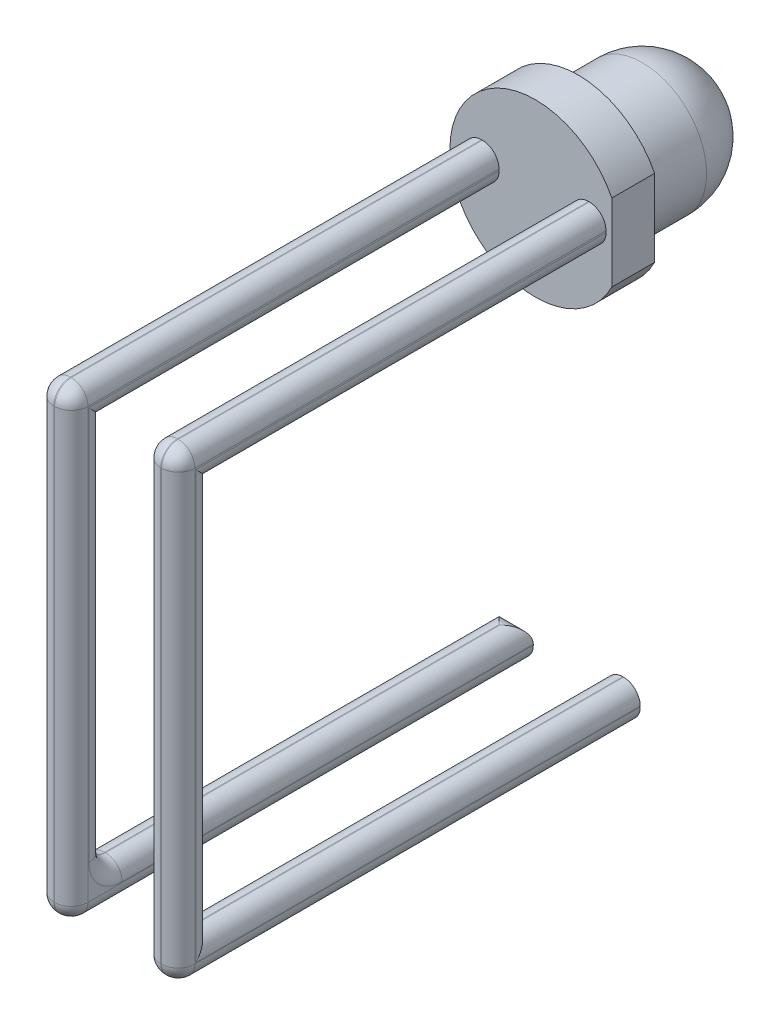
ISO-10303-21;
HEADER;
FILE_DESCRIPTION(('STEP AP214'),'2;1');
FILE_NAME('part.step','',(''),(''),'','','');
FILE_SCHEMA(('AUTOMOTIVE_DESIGN { 1 0 10303 214 1 1 1 1 }'));
ENDSEC;
DATA;
#1=APPLICATION_CONTEXT('core data for automotive mechanical design processes');
#2=APPLICATION_PROTOCOL_DEFINITION('international standard','automotive_design',2000,#1);
#3=PRODUCT_CONTEXT('',#1,'mechanical');
#4=PRODUCT('Part','Part','',(#3));
#5=PRODUCT_RELATED_PRODUCT_CATEGORY('part','',(#4));
#6=PRODUCT_DEFINITION_FORMATION('','',#4);
#7=PRODUCT_DEFINITION_CONTEXT('part definition',#1,'design');
#8=PRODUCT_DEFINITION('design','',#6,#7);
#9=PRODUCT_DEFINITION_SHAPE('','',#8);
#10=(LENGTH_UNIT() NAMED_UNIT(*) SI_UNIT(.MILLI.,.METRE.));
#11=(NAMED_UNIT(*) PLANE_ANGLE_UNIT() SI_UNIT($,.RADIAN.));
#12=(NAMED_UNIT(*) SI_UNIT($,.STERADIAN.) SOLID_ANGLE_UNIT());
#13=UNCERTAINTY_MEASURE_WITH_UNIT(LENGTH_MEASURE(1.E-05),#10,'distance_accuracy_value','');
#14=(GEOMETRIC_REPRESENTATION_CONTEXT(3) GLOBAL_UNCERTAINTY_ASSIGNED_CONTEXT((#13)) GLOBAL_UNIT_ASSIGNED_CONTEXT((#10,
#11,#12)) REPRESENTATION_CONTEXT('',''));
#15=CARTESIAN_POINT('',(0.,0.,0.));
#16=DIRECTION('',(0.,0.,1.));
#17=DIRECTION('',(1.,0.,0.));
#18=AXIS2_PLACEMENT_3D('',#15,#16,#17);
#19=CARTESIAN_POINT('',(-0.85,-10.2613044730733,13.2));
#20=DIRECTION('',(0.,0.,1.));
#21=DIRECTION('',(0.,-1.,0.));
#22=AXIS2_PLACEMENT_3D('',#19,#20,#21);
#23=PLANE('',#22);
#24=DIRECTION('',(1.,0.,0.));
#25=VECTOR('',#24,1.);
#26=CARTESIAN_POINT('',(-1.65,-9.07130447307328,13.2));
#27=LINE('',#26,#25);
#28=CARTESIAN_POINT('',(-1.24,-9.07130447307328,13.2));
#29=VERTEX_POINT('',#28);
#30=CARTESIAN_POINT('',(-1.26,-9.07130447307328,13.2));
#31=VERTEX_POINT('',#30);
#32=EDGE_CURVE('E364',#29,#31,#27,.F.);
#33=ORIENTED_EDGE('',*,*,#32,.T.);
#34=DIRECTION('',(0.,1.,0.));
#35=VECTOR('',#34,1.);
#36=CARTESIAN_POINT('',(-1.26,-10.2613044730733,13.2));
#37=LINE('',#36,#35);
#38=CARTESIAN_POINT('',(-1.26,-0.261304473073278,13.2));
#39=VERTEX_POINT('',#38);
#40=EDGE_CURVE('E366',#31,#39,#37,.T.);
#41=ORIENTED_EDGE('',*,*,#40,.T.);
#42=DIRECTION('',(1.,0.,0.));
#43=VECTOR('',#42,1.);
#44=CARTESIAN_POINT('',(-0.85,-0.261304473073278,13.2));
#45=LINE('',#44,#43);
#46=CARTESIAN_POINT('',(-1.24,-0.261304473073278,13.2));
#47=VERTEX_POINT('',#46);
#48=EDGE_CURVE('E601',#39,#47,#45,.T.);
#49=ORIENTED_EDGE('',*,*,#48,.T.);
#50=DIRECTION('',(0.,1.,0.));
#51=VECTOR('',#50,1.);
#52=CARTESIAN_POINT('',(-1.24,-9.46130447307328,13.2));
#53=LINE('',#52,#51);
#54=EDGE_CURVE('E362',#47,#29,#53,.F.);
#55=ORIENTED_EDGE('',*,*,#54,.T.);
#56=EDGE_LOOP('',(#33,#41,#49,#55));
#57=FACE_BOUND('',#56,.T.);
#58=ADVANCED_FACE('F26',(#57),#23,.F.);
#59=CARTESIAN_POINT('',(1.65,-10.2613044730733,13.2));
#60=DIRECTION('',(0.,0.,1.));
#61=DIRECTION('',(0.,-1.,0.));
#62=AXIS2_PLACEMENT_3D('',#59,#60,#61);
#63=PLANE('',#62);
#64=DIRECTION('',(1.,0.,0.));
#65=VECTOR('',#64,1.);
#66=CARTESIAN_POINT('',(1.65,-9.46130447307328,13.2));
#67=LINE('',#66,#65);
#68=CARTESIAN_POINT('',(1.24,-9.46130447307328,13.2));
#69=VERTEX_POINT('',#68);
#70=CARTESIAN_POINT('',(1.26,-9.46130447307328,13.2));
#71=VERTEX_POINT('',#70);
#72=EDGE_CURVE('E586',#69,#71,#67,.T.);
#73=ORIENTED_EDGE('',*,*,#72,.F.);
#74=DIRECTION('',(0.,1.,0.));
#75=VECTOR('',#74,1.);
#76=CARTESIAN_POINT('',(1.24,-0.261304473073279,13.2));
#77=LINE('',#76,#75);
#78=CARTESIAN_POINT('',(1.24,-0.261304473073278,13.2));
#79=VERTEX_POINT('',#78);
#80=EDGE_CURVE('E456',#69,#79,#77,.T.);
#81=ORIENTED_EDGE('',*,*,#80,.T.);
#82=DIRECTION('',(1.,0.,0.));
#83=VECTOR('',#82,1.);
#84=CARTESIAN_POINT('',(1.65,-0.261304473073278,13.2));
#85=LINE('',#84,#83);
#86=CARTESIAN_POINT('',(1.26,-0.261304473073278,13.2));
#87=VERTEX_POINT('',#86);
#88=EDGE_CURVE('E604',#79,#87,#85,.T.);
#89=ORIENTED_EDGE('',*,*,#88,.T.);
#90=DIRECTION('',(0.,1.,0.));
#91=VECTOR('',#90,1.);
#92=CARTESIAN_POINT('',(1.26,-9.46130447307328,13.2));
#93=LINE('',#92,#91);
#94=EDGE_CURVE('E454',#87,#71,#93,.F.);
#95=ORIENTED_EDGE('',*,*,#94,.T.);
#96=EDGE_LOOP('',(#73,#81,#89,#95));
#97=FACE_BOUND('',#96,.T.);
#98=ADVANCED_FACE('F714',(#97),#63,.F.);
#99=CARTESIAN_POINT('',(1.65,-0.261304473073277,4.));
#100=DIRECTION('',(0.,1.,0.));
#101=DIRECTION('',(0.,0.,1.));
#102=AXIS2_PLACEMENT_3D('',#99,#100,#101);
#103=PLANE('',#102);
#104=ORIENTED_EDGE('',*,*,#48,.F.);
#105=DIRECTION('',(0.,0.,-1.));
#106=VECTOR('',#105,1.);
#107=CARTESIAN_POINT('',(-1.26,-0.261304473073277,4.));
#108=LINE('',#107,#106);
#109=CARTESIAN_POINT('',(-1.26,-0.261304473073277,4.));
#110=VERTEX_POINT('',#109);
#111=EDGE_CURVE('E434',#39,#110,#108,.T.);
#112=ORIENTED_EDGE('',*,*,#111,.T.);
#113=DIRECTION('',(-1.,0.,0.));
#114=VECTOR('',#113,1.);
#115=CARTESIAN_POINT('',(1.65,-0.261304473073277,4.));
#116=LINE('',#115,#114);
#117=CARTESIAN_POINT('',(-1.24,-0.261304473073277,4.));
#118=VERTEX_POINT('',#117);
#119=EDGE_CURVE('E616',#118,#110,#116,.T.);
#120=ORIENTED_EDGE('',*,*,#119,.F.);
#121=DIRECTION('',(0.,0.,-1.));
#122=VECTOR('',#121,1.);
#123=CARTESIAN_POINT('',(-1.24,-0.261304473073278,13.2));
#124=LINE('',#123,#122);
#125=EDGE_CURVE('E432',#118,#47,#124,.F.);
#126=ORIENTED_EDGE('',*,*,#125,.T.);
#127=EDGE_LOOP('',(#104,#112,#120,#126));
#128=FACE_BOUND('',#127,.T.);
#129=ADVANCED_FACE('F745',(#128),#103,.F.);
#130=ORIENTED_EDGE('',*,*,#88,.F.);
#131=DIRECTION('',(0.,0.,1.));
#132=VECTOR('',#131,1.);
#133=CARTESIAN_POINT('',(1.24,-0.261304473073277,4.));
#134=LINE('',#133,#132);
#135=CARTESIAN_POINT('',(1.24,-0.261304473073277,4.));
#136=VERTEX_POINT('',#135);
#137=EDGE_CURVE('E438',#79,#136,#134,.F.);
#138=ORIENTED_EDGE('',*,*,#137,.T.);
#139=CARTESIAN_POINT('',(1.26,-0.261304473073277,4.));
#140=VERTEX_POINT('',#139);
#141=EDGE_CURVE('E289',#140,#136,#116,.T.);
#142=ORIENTED_EDGE('',*,*,#141,.F.);
#143=DIRECTION('',(0.,0.,-1.));
#144=VECTOR('',#143,1.);
#145=CARTESIAN_POINT('',(1.26,-0.261304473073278,13.2));
#146=LINE('',#145,#144);
#147=EDGE_CURVE('E436',#140,#87,#146,.F.);
#148=ORIENTED_EDGE('',*,*,#147,.T.);
#149=EDGE_LOOP('',(#130,#138,#142,#148));
#150=FACE_BOUND('',#149,.T.);
#151=ADVANCED_FACE('F773',(#150),#103,.F.);
#152=CARTESIAN_POINT('',(1.65,0.559015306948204,4.));
#153=DIRECTION('',(0.,-1.,0.));
#154=DIRECTION('',(0.,0.,-1.));
#155=AXIS2_PLACEMENT_3D('',#152,#153,#154);
#156=PLANE('',#155);
#157=DIRECTION('',(-1.,0.,0.));
#158=VECTOR('',#157,1.);
#159=CARTESIAN_POINT('',(1.65,0.559015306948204,4.));
#160=LINE('',#159,#158);
#161=CARTESIAN_POINT('',(-1.24,0.559015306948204,4.));
#162=VERTEX_POINT('',#161);
#163=CARTESIAN_POINT('',(-1.26,0.559015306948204,4.));
#164=VERTEX_POINT('',#163);
#165=EDGE_CURVE('E484',#162,#164,#160,.T.);
#166=ORIENTED_EDGE('',*,*,#165,.T.);
#167=DIRECTION('',(0.,0.,1.));
#168=VECTOR('',#167,1.);
#169=CARTESIAN_POINT('',(-1.26,0.559015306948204,4.));
#170=LINE('',#169,#168);
#171=CARTESIAN_POINT('',(-1.26,0.559015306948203,13.61));
#172=VERTEX_POINT('',#171);
#173=EDGE_CURVE('E410',#164,#172,#170,.T.);
#174=ORIENTED_EDGE('',*,*,#173,.T.);
#175=DIRECTION('',(-1.,0.,0.));
#176=VECTOR('',#175,1.);
#177=CARTESIAN_POINT('',(1.65,0.559015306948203,13.61));
#178=LINE('',#177,#176);
#179=CARTESIAN_POINT('',(-1.24,0.559015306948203,13.61));
#180=VERTEX_POINT('',#179);
#181=EDGE_CURVE('E408',#172,#180,#178,.F.);
#182=ORIENTED_EDGE('',*,*,#181,.T.);
#183=DIRECTION('',(0.,0.,1.));
#184=VECTOR('',#183,1.);
#185=CARTESIAN_POINT('',(-1.24,0.559015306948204,4.));
#186=LINE('',#185,#184);
#187=EDGE_CURVE('E406',#180,#162,#186,.F.);
#188=ORIENTED_EDGE('',*,*,#187,.T.);
#189=EDGE_LOOP('',(#166,#174,#182,#188));
#190=FACE_BOUND('',#189,.T.);
#191=ADVANCED_FACE('F770',(#190),#156,.F.);
#192=CARTESIAN_POINT('',(1.26,0.559015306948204,4.));
#193=VERTEX_POINT('',#192);
#194=CARTESIAN_POINT('',(1.24,0.559015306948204,4.));
#195=VERTEX_POINT('',#194);
#196=EDGE_CURVE('E477',#193,#195,#160,.T.);
#197=ORIENTED_EDGE('',*,*,#196,.T.);
#198=DIRECTION('',(0.,0.,-1.));
#199=VECTOR('',#198,1.);
#200=CARTESIAN_POINT('',(1.24,0.559015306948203,14.));
#201=LINE('',#200,#199);
#202=CARTESIAN_POINT('',(1.24,0.559015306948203,13.61));
#203=VERTEX_POINT('',#202);
#204=EDGE_CURVE('E404',#195,#203,#201,.F.);
#205=ORIENTED_EDGE('',*,*,#204,.T.);
#206=DIRECTION('',(-1.,0.,0.));
#207=VECTOR('',#206,1.);
#208=CARTESIAN_POINT('',(1.65,0.559015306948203,13.61));
#209=LINE('',#208,#207);
#210=CARTESIAN_POINT('',(1.26,0.559015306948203,13.61));
#211=VERTEX_POINT('',#210);
#212=EDGE_CURVE('E402',#203,#211,#209,.F.);
#213=ORIENTED_EDGE('',*,*,#212,.T.);
#214=DIRECTION('',(0.,0.,1.));
#215=VECTOR('',#214,1.);
#216=CARTESIAN_POINT('',(1.26,0.559015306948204,4.));
#217=LINE('',#216,#215);
#218=EDGE_CURVE('E400',#211,#193,#217,.F.);
#219=ORIENTED_EDGE('',*,*,#218,.T.);
#220=EDGE_LOOP('',(#197,#205,#213,#219));
#221=FACE_BOUND('',#220,.T.);
#222=ADVANCED_FACE('F625',(#221),#156,.F.);
#223=CARTESIAN_POINT('',(1.65,0.559015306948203,14.));
#224=DIRECTION('',(0.,0.,-1.));
#225=DIRECTION('',(-1.,0.,0.));
#226=AXIS2_PLACEMENT_3D('',#223,#224,#225);
#227=PLANE('',#226);
#228=DIRECTION('',(-1.,0.,0.));
#229=VECTOR('',#228,1.);
#230=CARTESIAN_POINT('',(1.65,0.169015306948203,14.));
#231=LINE('',#230,#229);
#232=CARTESIAN_POINT('',(-1.24,0.169015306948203,14.));
#233=VERTEX_POINT('',#232);
#234=CARTESIAN_POINT('',(-1.26,0.169015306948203,14.));
#235=VERTEX_POINT('',#234);
#236=EDGE_CURVE('E372',#233,#235,#231,.T.);
#237=ORIENTED_EDGE('',*,*,#236,.T.);
#238=DIRECTION('',(0.,-1.,0.));
#239=VECTOR('',#238,1.);
#240=CARTESIAN_POINT('',(-1.26,0.559015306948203,14.));
#241=LINE('',#240,#239);
#242=CARTESIAN_POINT('',(-1.26,-9.87130447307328,14.));
#243=VERTEX_POINT('',#242);
#244=EDGE_CURVE('E374',#235,#243,#241,.T.);
#245=ORIENTED_EDGE('',*,*,#244,.T.);
#246=DIRECTION('',(-1.,0.,0.));
#247=VECTOR('',#246,1.);
#248=CARTESIAN_POINT('',(1.65,-9.87130447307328,14.));
#249=LINE('',#248,#247);
#250=CARTESIAN_POINT('',(-1.24,-9.87130447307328,14.));
#251=VERTEX_POINT('',#250);
#252=EDGE_CURVE('E370',#243,#251,#249,.F.);
#253=ORIENTED_EDGE('',*,*,#252,.T.);
#254=DIRECTION('',(0.,-1.,0.));
#255=VECTOR('',#254,1.);
#256=CARTESIAN_POINT('',(-1.24,0.559015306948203,14.));
#257=LINE('',#256,#255);
#258=EDGE_CURVE('E368',#251,#233,#257,.F.);
#259=ORIENTED_EDGE('',*,*,#258,.T.);
#260=EDGE_LOOP('',(#237,#245,#253,#259));
#261=FACE_BOUND('',#260,.T.);
#262=ADVANCED_FACE('F766',(#261),#227,.F.);
#263=DIRECTION('',(-1.,0.,0.));
#264=VECTOR('',#263,1.);
#265=CARTESIAN_POINT('',(1.65,0.169015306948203,14.));
#266=LINE('',#265,#264);
#267=CARTESIAN_POINT('',(1.26,0.169015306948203,14.));
#268=VERTEX_POINT('',#267);
#269=CARTESIAN_POINT('',(1.24,0.169015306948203,14.));
#270=VERTEX_POINT('',#269);
#271=EDGE_CURVE('E395',#268,#270,#266,.T.);
#272=ORIENTED_EDGE('',*,*,#271,.T.);
#273=DIRECTION('',(0.,1.,0.));
#274=VECTOR('',#273,1.);
#275=CARTESIAN_POINT('',(1.24,-10.2613044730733,14.));
#276=LINE('',#275,#274);
#277=CARTESIAN_POINT('',(1.24,-9.87130447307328,14.));
#278=VERTEX_POINT('',#277);
#279=EDGE_CURVE('E397',#270,#278,#276,.F.);
#280=ORIENTED_EDGE('',*,*,#279,.T.);
#281=DIRECTION('',(-1.,0.,0.));
#282=VECTOR('',#281,1.);
#283=CARTESIAN_POINT('',(1.65,-9.87130447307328,14.));
#284=LINE('',#283,#282);
#285=CARTESIAN_POINT('',(1.26,-9.87130447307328,14.));
#286=VERTEX_POINT('',#285);
#287=EDGE_CURVE('E393',#278,#286,#284,.F.);
#288=ORIENTED_EDGE('',*,*,#287,.T.);
#289=DIRECTION('',(0.,-1.,0.));
#290=VECTOR('',#289,1.);
#291=CARTESIAN_POINT('',(1.26,0.559015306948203,14.));
#292=LINE('',#291,#290);
#293=EDGE_CURVE('E391',#286,#268,#292,.F.);
#294=ORIENTED_EDGE('',*,*,#293,.T.);
#295=EDGE_LOOP('',(#272,#280,#288,#294));
#296=FACE_BOUND('',#295,.T.);
#297=ADVANCED_FACE('F656',(#296),#227,.F.);
#298=CARTESIAN_POINT('',(0.,0.,4.));
#299=DIRECTION('',(0.,0.,-1.));
#300=DIRECTION('',(-1.,0.,0.));
#301=AXIS2_PLACEMENT_3D('',#298,#299,#300);
#302=CYLINDRICAL_SURFACE('',#301,1.5);
#303=CARTESIAN_POINT('',(0.,0.,1.5));
#304=DIRECTION('',(0.,0.,-1.));
#305=DIRECTION('',(-1.,0.,0.));
#306=AXIS2_PLACEMENT_3D('',#303,#304,#305);
#307=CIRCLE('',#306,1.5);
#308=CARTESIAN_POINT('',(-1.5,0.,1.5));
#309=VERTEX_POINT('',#308);
#310=EDGE_CURVE('E312',#309,#309,#307,.F.);
#311=ORIENTED_EDGE('',*,*,#310,.T.);
#312=EDGE_LOOP('',(#311));
#313=FACE_BOUND('',#312,.T.);
#314=CARTESIAN_POINT('',(0.,0.,3.));
#315=DIRECTION('',(0.,0.,1.));
#316=DIRECTION('',(1.,0.,0.));
#317=AXIS2_PLACEMENT_3D('',#314,#315,#316);
#318=CIRCLE('',#317,1.5);
#319=CARTESIAN_POINT('',(1.5,0.,3.));
#320=VERTEX_POINT('',#319);
#321=EDGE_CURVE('E308',#320,#320,#318,.T.);
#322=ORIENTED_EDGE('',*,*,#321,.F.);
#323=EDGE_LOOP('',(#322));
#324=FACE_BOUND('',#323,.T.);
#325=ADVANCED_FACE('F28',(#313,#324),#302,.T.);
#326=CARTESIAN_POINT('',(0.,0.,3.));
#327=DIRECTION('',(0.,0.,1.));
#328=DIRECTION('',(1.,0.,0.));
#329=AXIS2_PLACEMENT_3D('',#326,#327,#328);
#330=PLANE('',#329);
#331=CARTESIAN_POINT('',(0.,0.,3.));
#332=DIRECTION('',(0.,0.,1.));
#333=DIRECTION('',(1.,0.,0.));
#334=AXIS2_PLACEMENT_3D('',#331,#332,#333);
#335=CIRCLE('',#334,2.);
#336=CARTESIAN_POINT('',(1.78571428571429,0.900680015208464,3.));
#337=VERTEX_POINT('',#336);
#338=CARTESIAN_POINT('',(1.78571428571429,-0.900680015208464,3.));
#339=VERTEX_POINT('',#338);
#340=EDGE_CURVE('E295',#337,#339,#335,.T.);
#341=ORIENTED_EDGE('',*,*,#340,.F.);
#342=DIRECTION('',(0.,1.,0.));
#343=VECTOR('',#342,1.);
#344=CARTESIAN_POINT('',(1.78571428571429,0.900680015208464,3.));
#345=LINE('',#344,#343);
#346=EDGE_CURVE('E300',#339,#337,#345,.T.);
#347=ORIENTED_EDGE('',*,*,#346,.F.);
#348=EDGE_LOOP('',(#341,#347));
#349=FACE_BOUND('',#348,.T.);
#350=ORIENTED_EDGE('',*,*,#321,.T.);
#351=EDGE_LOOP('',(#350));
#352=FACE_BOUND('',#351,.T.);
#353=ADVANCED_FACE('F781',(#349,#352),#330,.F.);
#354=CARTESIAN_POINT('',(0.,0.,3.));
#355=DIRECTION('',(0.,0.,1.));
#356=DIRECTION('',(1.,0.,0.));
#357=AXIS2_PLACEMENT_3D('',#354,#355,#356);
#358=CYLINDRICAL_SURFACE('',#357,2.);
#359=CARTESIAN_POINT('',(0.,0.,4.));
#360=DIRECTION('',(0.,0.,1.));
#361=DIRECTION('',(1.,0.,0.));
#362=AXIS2_PLACEMENT_3D('',#359,#360,#361);
#363=CIRCLE('',#362,2.);
#364=CARTESIAN_POINT('',(1.78571428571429,0.900680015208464,4.));
#365=VERTEX_POINT('',#364);
#366=CARTESIAN_POINT('',(1.78571428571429,-0.900680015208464,4.));
#367=VERTEX_POINT('',#366);
#368=EDGE_CURVE('E283',#365,#367,#363,.T.);
#369=ORIENTED_EDGE('',*,*,#368,.F.);
#370=DIRECTION('',(0.,0.,1.));
#371=VECTOR('',#370,1.);
#372=CARTESIAN_POINT('',(1.78571428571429,0.900680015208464,3.));
#373=LINE('',#372,#371);
#374=EDGE_CURVE('E299',#337,#365,#373,.T.);
#375=ORIENTED_EDGE('',*,*,#374,.F.);
#376=ORIENTED_EDGE('',*,*,#340,.T.);
#377=DIRECTION('',(0.,0.,1.));
#378=VECTOR('',#377,1.);
#379=CARTESIAN_POINT('',(1.78571428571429,-0.900680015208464,3.));
#380=LINE('',#379,#378);
#381=EDGE_CURVE('E292',#339,#367,#380,.T.);
#382=ORIENTED_EDGE('',*,*,#381,.T.);
#383=EDGE_LOOP('',(#369,#375,#376,#382));
#384=FACE_BOUND('',#383,.T.);
#385=ADVANCED_FACE('F293',(#384),#358,.T.);
#386=CARTESIAN_POINT('',(1.78571428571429,0.900680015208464,3.));
#387=DIRECTION('',(1.,0.,0.));
#388=DIRECTION('',(0.,0.,-1.));
#389=AXIS2_PLACEMENT_3D('',#386,#387,#388);
#390=PLANE('',#389);
#391=DIRECTION('',(0.,1.,0.));
#392=VECTOR('',#391,1.);
#393=CARTESIAN_POINT('',(1.78571428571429,0.900680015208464,4.));
#394=LINE('',#393,#392);
#395=EDGE_CURVE('E287',#367,#365,#394,.T.);
#396=ORIENTED_EDGE('',*,*,#395,.F.);
#397=ORIENTED_EDGE('',*,*,#381,.F.);
#398=ORIENTED_EDGE('',*,*,#346,.T.);
#399=ORIENTED_EDGE('',*,*,#374,.T.);
#400=EDGE_LOOP('',(#396,#397,#398,#399));
#401=FACE_BOUND('',#400,.T.);
#402=ADVANCED_FACE('F302',(#401),#390,.T.);
#403=CARTESIAN_POINT('',(0.,0.,4.));
#404=DIRECTION('',(0.,0.,1.));
#405=DIRECTION('',(1.,0.,0.));
#406=AXIS2_PLACEMENT_3D('',#403,#404,#405);
#407=PLANE('',#406);
#408=ORIENTED_EDGE('',*,*,#165,.F.);
#409=CARTESIAN_POINT('',(-1.24,0.169015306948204,4.));
#410=DIRECTION('',(0.,0.,1.));
#411=DIRECTION('',(1.,0.,0.));
#412=AXIS2_PLACEMENT_3D('',#409,#410,#411);
#413=CIRCLE('',#412,0.39);
#414=CARTESIAN_POINT('',(-0.85,0.169015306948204,4.));
#415=VERTEX_POINT('',#414);
#416=EDGE_CURVE('E468',#162,#415,#413,.F.);
#417=ORIENTED_EDGE('',*,*,#416,.T.);
#418=DIRECTION('',(0.,-1.,0.));
#419=VECTOR('',#418,1.);
#420=CARTESIAN_POINT('',(-0.85,0.623900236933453,4.));
#421=LINE('',#420,#419);
#422=CARTESIAN_POINT('',(-0.85,0.128695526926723,4.));
#423=VERTEX_POINT('',#422);
#424=EDGE_CURVE('E607',#415,#423,#421,.T.);
#425=ORIENTED_EDGE('',*,*,#424,.T.);
#426=CARTESIAN_POINT('',(-1.24,0.128695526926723,4.));
#427=DIRECTION('',(0.,0.,1.));
#428=DIRECTION('',(1.,0.,0.));
#429=AXIS2_PLACEMENT_3D('',#426,#427,#428);
#430=CIRCLE('',#429,0.39);
#431=EDGE_CURVE('E464',#423,#118,#430,.F.);
#432=ORIENTED_EDGE('',*,*,#431,.T.);
#433=ORIENTED_EDGE('',*,*,#119,.T.);
#434=CARTESIAN_POINT('',(-1.26,0.128695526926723,4.));
#435=DIRECTION('',(0.,0.,1.));
#436=DIRECTION('',(1.,0.,0.));
#437=AXIS2_PLACEMENT_3D('',#434,#435,#436);
#438=CIRCLE('',#437,0.39);
#439=CARTESIAN_POINT('',(-1.65,0.128695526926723,4.));
#440=VERTEX_POINT('',#439);
#441=EDGE_CURVE('E458',#110,#440,#438,.F.);
#442=ORIENTED_EDGE('',*,*,#441,.T.);
#443=DIRECTION('',(0.,1.,0.));
#444=VECTOR('',#443,1.);
#445=CARTESIAN_POINT('',(-1.65,-0.261304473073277,4.));
#446=LINE('',#445,#444);
#447=CARTESIAN_POINT('',(-1.65,0.169015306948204,4.));
#448=VERTEX_POINT('',#447);
#449=EDGE_CURVE('E485',#440,#448,#446,.T.);
#450=ORIENTED_EDGE('',*,*,#449,.T.);
#451=CARTESIAN_POINT('',(-1.26,0.169015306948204,4.));
#452=DIRECTION('',(0.,0.,1.));
#453=DIRECTION('',(1.,0.,0.));
#454=AXIS2_PLACEMENT_3D('',#451,#452,#453);
#455=CIRCLE('',#454,0.39);
#456=EDGE_CURVE('E466',#448,#164,#455,.F.);
#457=ORIENTED_EDGE('',*,*,#456,.T.);
#458=EDGE_LOOP('',(#408,#417,#425,#432,#433,#442,#450,#457));
#459=FACE_BOUND('',#458,.T.);
#460=ORIENTED_EDGE('',*,*,#141,.T.);
#461=CARTESIAN_POINT('',(1.24,0.128695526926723,4.));
#462=DIRECTION('',(0.,0.,1.));
#463=DIRECTION('',(1.,0.,0.));
#464=AXIS2_PLACEMENT_3D('',#461,#462,#463);
#465=CIRCLE('',#464,0.39);
#466=CARTESIAN_POINT('',(0.85,0.128695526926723,4.));
#467=VERTEX_POINT('',#466);
#468=EDGE_CURVE('E460',#136,#467,#465,.F.);
#469=ORIENTED_EDGE('',*,*,#468,.T.);
#470=DIRECTION('',(0.,1.,0.));
#471=VECTOR('',#470,1.);
#472=CARTESIAN_POINT('',(0.85,0.623900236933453,4.));
#473=LINE('',#472,#471);
#474=CARTESIAN_POINT('',(0.85,0.169015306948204,4.));
#475=VERTEX_POINT('',#474);
#476=EDGE_CURVE('E610',#467,#475,#473,.T.);
#477=ORIENTED_EDGE('',*,*,#476,.T.);
#478=CARTESIAN_POINT('',(1.24,0.169015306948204,4.));
#479=DIRECTION('',(0.,0.,1.));
#480=DIRECTION('',(1.,0.,0.));
#481=AXIS2_PLACEMENT_3D('',#478,#479,#480);
#482=CIRCLE('',#481,0.39);
#483=EDGE_CURVE('E462',#475,#195,#482,.F.);
#484=ORIENTED_EDGE('',*,*,#483,.T.);
#485=ORIENTED_EDGE('',*,*,#196,.F.);
#486=CARTESIAN_POINT('',(1.26,0.169015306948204,4.));
#487=DIRECTION('',(0.,0.,1.));
#488=DIRECTION('',(1.,0.,0.));
#489=AXIS2_PLACEMENT_3D('',#486,#487,#488);
#490=CIRCLE('',#489,0.39);
#491=CARTESIAN_POINT('',(1.65,0.169015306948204,4.));
#492=VERTEX_POINT('',#491);
#493=EDGE_CURVE('E34',#193,#492,#490,.F.);
#494=ORIENTED_EDGE('',*,*,#493,.T.);
#495=DIRECTION('',(0.,1.,0.));
#496=VECTOR('',#495,1.);
#497=CARTESIAN_POINT('',(1.65,-0.261304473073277,4.));
#498=LINE('',#497,#496);
#499=CARTESIAN_POINT('',(1.65,0.128695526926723,4.));
#500=VERTEX_POINT('',#499);
#501=EDGE_CURVE('E475',#500,#492,#498,.T.);
#502=ORIENTED_EDGE('',*,*,#501,.F.);
#503=CARTESIAN_POINT('',(1.26,0.128695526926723,4.));
#504=DIRECTION('',(0.,0.,1.));
#505=DIRECTION('',(1.,0.,0.));
#506=AXIS2_PLACEMENT_3D('',#503,#504,#505);
#507=CIRCLE('',#506,0.39);
#508=EDGE_CURVE('E11',#500,#140,#507,.F.);
#509=ORIENTED_EDGE('',*,*,#508,.T.);
#510=EDGE_LOOP('',(#460,#469,#477,#484,#485,#494,#502,#509));
#511=FACE_BOUND('',#510,.T.);
#512=ORIENTED_EDGE('',*,*,#368,.T.);
#513=ORIENTED_EDGE('',*,*,#395,.T.);
#514=EDGE_LOOP('',(#512,#513));
#515=FACE_BOUND('',#514,.T.);
#516=ADVANCED_FACE('F285',(#459,#511,#515),#407,.T.);
#517=CARTESIAN_POINT('',(0.,0.,1.5));
#518=DIRECTION('',(0.,0.,1.));
#519=DIRECTION('',(1.,0.,0.));
#520=AXIS2_PLACEMENT_3D('',#517,#518,#519);
#521=SPHERICAL_SURFACE('',#520,1.5);
#522=ORIENTED_EDGE('',*,*,#310,.F.);
#523=EDGE_LOOP('',(#522));
#524=FACE_BOUND('',#523,.T.);
#525=ADVANCED_FACE('F765',(#524),#521,.T.);
#526=CARTESIAN_POINT('',(1.65,-0.261304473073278,14.));
#527=DIRECTION('',(1.,0.,0.));
#528=DIRECTION('',(0.,0.,-1.));
#529=AXIS2_PLACEMENT_3D('',#526,#527,#528);
#530=PLANE('',#529);
#531=DIRECTION('',(0.,1.,0.));
#532=VECTOR('',#531,1.);
#533=CARTESIAN_POINT('',(1.65,-0.261304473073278,13.59));
#534=LINE('',#533,#532);
#535=CARTESIAN_POINT('',(1.65,-9.85130447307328,13.59));
#536=VERTEX_POINT('',#535);
#537=CARTESIAN_POINT('',(1.65,0.128695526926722,13.59));
#538=VERTEX_POINT('',#537);
#539=EDGE_CURVE('E41',#536,#538,#534,.T.);
#540=ORIENTED_EDGE('',*,*,#539,.T.);
#541=DIRECTION('',(0.,0.,-1.));
#542=VECTOR('',#541,1.);
#543=CARTESIAN_POINT('',(1.65,0.128695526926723,4.));
#544=LINE('',#543,#542);
#545=EDGE_CURVE('E452',#538,#500,#544,.T.);
#546=ORIENTED_EDGE('',*,*,#545,.T.);
#547=ORIENTED_EDGE('',*,*,#501,.T.);
#548=DIRECTION('',(0.,0.,1.));
#549=VECTOR('',#548,1.);
#550=CARTESIAN_POINT('',(1.65,0.169015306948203,14.));
#551=LINE('',#550,#549);
#552=CARTESIAN_POINT('',(1.65,0.169015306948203,13.61));
#553=VERTEX_POINT('',#552);
#554=EDGE_CURVE('E448',#492,#553,#551,.T.);
#555=ORIENTED_EDGE('',*,*,#554,.T.);
#556=DIRECTION('',(0.,-1.,0.));
#557=VECTOR('',#556,1.);
#558=CARTESIAN_POINT('',(1.65,-10.2613044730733,13.61));
#559=LINE('',#558,#557);
#560=CARTESIAN_POINT('',(1.65,-9.87130447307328,13.61));
#561=VERTEX_POINT('',#560);
#562=EDGE_CURVE('E444',#553,#561,#559,.T.);
#563=ORIENTED_EDGE('',*,*,#562,.T.);
#564=DIRECTION('',(0.,0.,1.));
#565=VECTOR('',#564,1.);
#566=CARTESIAN_POINT('',(1.65,-9.87130447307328,3.2));
#567=LINE('',#566,#565);
#568=CARTESIAN_POINT('',(1.65,-9.87130447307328,3.2));
#569=VERTEX_POINT('',#568);
#570=EDGE_CURVE('E446',#561,#569,#567,.F.);
#571=ORIENTED_EDGE('',*,*,#570,.T.);
#572=DIRECTION('',(0.,-1.,0.));
#573=VECTOR('',#572,1.);
#574=CARTESIAN_POINT('',(1.65,-10.2613044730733,3.2));
#575=LINE('',#574,#573);
#576=CARTESIAN_POINT('',(1.65,-9.85130447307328,3.2));
#577=VERTEX_POINT('',#576);
#578=EDGE_CURVE('E589',#577,#569,#575,.T.);
#579=ORIENTED_EDGE('',*,*,#578,.F.);
#580=DIRECTION('',(0.,0.,1.));
#581=VECTOR('',#580,1.);
#582=CARTESIAN_POINT('',(1.65,-9.85130447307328,13.2));
#583=LINE('',#582,#581);
#584=EDGE_CURVE('E46',#577,#536,#583,.T.);
#585=ORIENTED_EDGE('',*,*,#584,.T.);
#586=EDGE_LOOP('',(#540,#546,#547,#555,#563,#571,#579,#585));
#587=FACE_BOUND('',#586,.T.);
#588=ADVANCED_FACE('F481',(#587),#530,.T.);
#589=CARTESIAN_POINT('',(-1.65,-0.261304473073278,14.));
#590=DIRECTION('',(1.,0.,0.));
#591=DIRECTION('',(0.,0.,-1.));
#592=AXIS2_PLACEMENT_3D('',#589,#590,#591);
#593=PLANE('',#592);
#594=DIRECTION('',(0.,1.,0.));
#595=VECTOR('',#594,1.);
#596=CARTESIAN_POINT('',(-1.65,-10.2613044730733,3.2));
#597=LINE('',#596,#595);
#598=CARTESIAN_POINT('',(-1.65,-9.87130447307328,3.2));
#599=VERTEX_POINT('',#598);
#600=CARTESIAN_POINT('',(-1.65,-9.85130447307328,3.2));
#601=VERTEX_POINT('',#600);
#602=EDGE_CURVE('E583',#599,#601,#597,.T.);
#603=ORIENTED_EDGE('',*,*,#602,.F.);
#604=DIRECTION('',(0.,0.,-1.));
#605=VECTOR('',#604,1.);
#606=CARTESIAN_POINT('',(-1.65,-9.87130447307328,14.));
#607=LINE('',#606,#605);
#608=CARTESIAN_POINT('',(-1.65,-9.87130447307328,13.61));
#609=VERTEX_POINT('',#608);
#610=EDGE_CURVE('E339',#599,#609,#607,.F.);
#611=ORIENTED_EDGE('',*,*,#610,.T.);
#612=DIRECTION('',(0.,-1.,0.));
#613=VECTOR('',#612,1.);
#614=CARTESIAN_POINT('',(-1.65,-0.261304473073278,13.61));
#615=LINE('',#614,#613);
#616=CARTESIAN_POINT('',(-1.65,0.169015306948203,13.61));
#617=VERTEX_POINT('',#616);
#618=EDGE_CURVE('E336',#609,#617,#615,.F.);
#619=ORIENTED_EDGE('',*,*,#618,.T.);
#620=DIRECTION('',(0.,0.,1.));
#621=VECTOR('',#620,1.);
#622=CARTESIAN_POINT('',(-1.65,0.169015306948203,14.));
#623=LINE('',#622,#621);
#624=EDGE_CURVE('E334',#617,#448,#623,.F.);
#625=ORIENTED_EDGE('',*,*,#624,.T.);
#626=ORIENTED_EDGE('',*,*,#449,.F.);
#627=DIRECTION('',(0.,0.,-1.));
#628=VECTOR('',#627,1.);
#629=CARTESIAN_POINT('',(-1.65,0.128695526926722,14.));
#630=LINE('',#629,#628);
#631=CARTESIAN_POINT('',(-1.65,0.128695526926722,13.59));
#632=VERTEX_POINT('',#631);
#633=EDGE_CURVE('E329',#440,#632,#630,.F.);
#634=ORIENTED_EDGE('',*,*,#633,.T.);
#635=DIRECTION('',(0.,1.,0.));
#636=VECTOR('',#635,1.);
#637=CARTESIAN_POINT('',(-1.65,-0.261304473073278,13.59));
#638=LINE('',#637,#636);
#639=CARTESIAN_POINT('',(-1.65,-9.07130447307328,13.59));
#640=VERTEX_POINT('',#639);
#641=EDGE_CURVE('E327',#632,#640,#638,.F.);
#642=ORIENTED_EDGE('',*,*,#641,.T.);
#643=CARTESIAN_POINT('',(-1.65,-9.07130447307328,12.81));
#644=DIRECTION('',(1.,0.,0.));
#645=DIRECTION('',(0.,0.,-1.));
#646=AXIS2_PLACEMENT_3D('',#643,#644,#645);
#647=CIRCLE('',#646,0.78);
#648=CARTESIAN_POINT('',(-1.65,-9.85130447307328,12.81));
#649=VERTEX_POINT('',#648);
#650=EDGE_CURVE('E324',#649,#640,#647,.F.);
#651=ORIENTED_EDGE('',*,*,#650,.F.);
#652=DIRECTION('',(0.,0.,1.));
#653=VECTOR('',#652,1.);
#654=CARTESIAN_POINT('',(-1.65,-9.85130447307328,14.));
#655=LINE('',#654,#653);
#656=EDGE_CURVE('E331',#649,#601,#655,.F.);
#657=ORIENTED_EDGE('',*,*,#656,.T.);
#658=EDGE_LOOP('',(#603,#611,#619,#625,#626,#634,#642,#651,#657));
#659=FACE_BOUND('',#658,.T.);
#660=ADVANCED_FACE('F758',(#659),#593,.F.);
#661=CARTESIAN_POINT('',(-0.85,0.623900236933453,14.));
#662=DIRECTION('',(1.,0.,0.));
#663=DIRECTION('',(0.,0.,-1.));
#664=AXIS2_PLACEMENT_3D('',#661,#662,#663);
#665=PLANE('',#664);
#666=DIRECTION('',(0.,-1.,0.));
#667=VECTOR('',#666,1.);
#668=CARTESIAN_POINT('',(-0.85,-10.2613044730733,3.2));
#669=LINE('',#668,#667);
#670=CARTESIAN_POINT('',(-0.85,-9.85130447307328,3.2));
#671=VERTEX_POINT('',#670);
#672=CARTESIAN_POINT('',(-0.85,-9.87130447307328,3.2));
#673=VERTEX_POINT('',#672);
#674=EDGE_CURVE('E577',#671,#673,#669,.T.);
#675=ORIENTED_EDGE('',*,*,#674,.F.);
#676=DIRECTION('',(0.,0.,1.));
#677=VECTOR('',#676,1.);
#678=CARTESIAN_POINT('',(-0.85,-9.85130447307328,13.2));
#679=LINE('',#678,#677);
#680=CARTESIAN_POINT('',(-0.85,-9.85130447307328,12.81));
#681=VERTEX_POINT('',#680);
#682=EDGE_CURVE('E360',#671,#681,#679,.T.);
#683=ORIENTED_EDGE('',*,*,#682,.T.);
#684=CARTESIAN_POINT('',(-0.85,-9.07130447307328,12.81));
#685=DIRECTION('',(1.,0.,0.));
#686=DIRECTION('',(0.,0.,-1.));
#687=AXIS2_PLACEMENT_3D('',#684,#685,#686);
#688=CIRCLE('',#687,0.78);
#689=CARTESIAN_POINT('',(-0.85,-9.07130447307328,13.59));
#690=VERTEX_POINT('',#689);
#691=EDGE_CURVE('E357',#690,#681,#688,.T.);
#692=ORIENTED_EDGE('',*,*,#691,.F.);
#693=DIRECTION('',(0.,1.,0.));
#694=VECTOR('',#693,1.);
#695=CARTESIAN_POINT('',(-0.85,-0.261304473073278,13.59));
#696=LINE('',#695,#694);
#697=CARTESIAN_POINT('',(-0.85,0.128695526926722,13.59));
#698=VERTEX_POINT('',#697);
#699=EDGE_CURVE('E353',#690,#698,#696,.T.);
#700=ORIENTED_EDGE('',*,*,#699,.T.);
#701=DIRECTION('',(0.,0.,-1.));
#702=VECTOR('',#701,1.);
#703=CARTESIAN_POINT('',(-0.85,0.128695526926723,4.));
#704=LINE('',#703,#702);
#705=EDGE_CURVE('E355',#698,#423,#704,.T.);
#706=ORIENTED_EDGE('',*,*,#705,.T.);
#707=ORIENTED_EDGE('',*,*,#424,.F.);
#708=DIRECTION('',(0.,0.,1.));
#709=VECTOR('',#708,1.);
#710=CARTESIAN_POINT('',(-0.85,0.169015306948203,14.));
#711=LINE('',#710,#709);
#712=CARTESIAN_POINT('',(-0.85,0.169015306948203,13.61));
#713=VERTEX_POINT('',#712);
#714=EDGE_CURVE('E351',#415,#713,#711,.T.);
#715=ORIENTED_EDGE('',*,*,#714,.T.);
#716=DIRECTION('',(0.,-1.,0.));
#717=VECTOR('',#716,1.);
#718=CARTESIAN_POINT('',(-0.85,-10.2613044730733,13.61));
#719=LINE('',#718,#717);
#720=CARTESIAN_POINT('',(-0.85,-9.87130447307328,13.61));
#721=VERTEX_POINT('',#720);
#722=EDGE_CURVE('E347',#713,#721,#719,.T.);
#723=ORIENTED_EDGE('',*,*,#722,.T.);
#724=DIRECTION('',(0.,0.,1.));
#725=VECTOR('',#724,1.);
#726=CARTESIAN_POINT('',(-0.85,-9.87130447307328,3.2));
#727=LINE('',#726,#725);
#728=EDGE_CURVE('E349',#721,#673,#727,.F.);
#729=ORIENTED_EDGE('',*,*,#728,.T.);
#730=EDGE_LOOP('',(#675,#683,#692,#700,#706,#707,#715,#723,#729));
#731=FACE_BOUND('',#730,.T.);
#732=ADVANCED_FACE('F755',(#731),#665,.T.);
#733=CARTESIAN_POINT('',(0.85,0.623900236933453,14.));
#734=DIRECTION('',(-1.,0.,0.));
#735=DIRECTION('',(0.,0.,1.));
#736=AXIS2_PLACEMENT_3D('',#733,#734,#735);
#737=PLANE('',#736);
#738=DIRECTION('',(0.,1.,0.));
#739=VECTOR('',#738,1.);
#740=CARTESIAN_POINT('',(0.85,-10.2613044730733,3.2));
#741=LINE('',#740,#739);
#742=CARTESIAN_POINT('',(0.85,-9.87130447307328,3.2));
#743=VERTEX_POINT('',#742);
#744=CARTESIAN_POINT('',(0.85,-9.85130447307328,3.2));
#745=VERTEX_POINT('',#744);
#746=EDGE_CURVE('E595',#743,#745,#741,.T.);
#747=ORIENTED_EDGE('',*,*,#746,.F.);
#748=DIRECTION('',(0.,0.,-1.));
#749=VECTOR('',#748,1.);
#750=CARTESIAN_POINT('',(0.85,-9.87130447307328,14.));
#751=LINE('',#750,#749);
#752=CARTESIAN_POINT('',(0.85,-9.87130447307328,13.61));
#753=VERTEX_POINT('',#752);
#754=EDGE_CURVE('E389',#743,#753,#751,.F.);
#755=ORIENTED_EDGE('',*,*,#754,.T.);
#756=DIRECTION('',(0.,1.,0.));
#757=VECTOR('',#756,1.);
#758=CARTESIAN_POINT('',(0.85,0.559015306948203,13.61));
#759=LINE('',#758,#757);
#760=CARTESIAN_POINT('',(0.85,0.169015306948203,13.61));
#761=VERTEX_POINT('',#760);
#762=EDGE_CURVE('E386',#753,#761,#759,.T.);
#763=ORIENTED_EDGE('',*,*,#762,.T.);
#764=DIRECTION('',(0.,0.,-1.));
#765=VECTOR('',#764,1.);
#766=CARTESIAN_POINT('',(0.85,0.169015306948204,4.));
#767=LINE('',#766,#765);
#768=EDGE_CURVE('E384',#761,#475,#767,.T.);
#769=ORIENTED_EDGE('',*,*,#768,.T.);
#770=ORIENTED_EDGE('',*,*,#476,.F.);
#771=DIRECTION('',(0.,0.,1.));
#772=VECTOR('',#771,1.);
#773=CARTESIAN_POINT('',(0.85,0.128695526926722,13.2));
#774=LINE('',#773,#772);
#775=CARTESIAN_POINT('',(0.85,0.128695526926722,13.59));
#776=VERTEX_POINT('',#775);
#777=EDGE_CURVE('E381',#467,#776,#774,.T.);
#778=ORIENTED_EDGE('',*,*,#777,.T.);
#779=DIRECTION('',(0.,1.,0.));
#780=VECTOR('',#779,1.);
#781=CARTESIAN_POINT('',(0.85,-9.46130447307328,13.59));
#782=LINE('',#781,#780);
#783=CARTESIAN_POINT('',(0.85,-9.85130447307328,13.59));
#784=VERTEX_POINT('',#783);
#785=EDGE_CURVE('E377',#776,#784,#782,.F.);
#786=ORIENTED_EDGE('',*,*,#785,.T.);
#787=DIRECTION('',(0.,0.,1.));
#788=VECTOR('',#787,1.);
#789=CARTESIAN_POINT('',(0.85,-9.85130447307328,3.2));
#790=LINE('',#789,#788);
#791=EDGE_CURVE('E379',#784,#745,#790,.F.);
#792=ORIENTED_EDGE('',*,*,#791,.T.);
#793=EDGE_LOOP('',(#747,#755,#763,#769,#770,#778,#786,#792));
#794=FACE_BOUND('',#793,.T.);
#795=ADVANCED_FACE('F684',(#794),#737,.T.);
#796=CARTESIAN_POINT('',(1.65,-10.2613044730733,13.2));
#797=DIRECTION('',(0.,1.,0.));
#798=DIRECTION('',(0.,0.,1.));
#799=AXIS2_PLACEMENT_3D('',#796,#797,#798);
#800=PLANE('',#799);
#801=DIRECTION('',(-1.,0.,0.));
#802=VECTOR('',#801,1.);
#803=CARTESIAN_POINT('',(1.65,-10.2613044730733,13.61));
#804=LINE('',#803,#802);
#805=CARTESIAN_POINT('',(1.26,-10.2613044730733,13.61));
#806=VERTEX_POINT('',#805);
#807=CARTESIAN_POINT('',(1.24,-10.2613044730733,13.61));
#808=VERTEX_POINT('',#807);
#809=EDGE_CURVE('E420',#806,#808,#804,.T.);
#810=ORIENTED_EDGE('',*,*,#809,.T.);
#811=DIRECTION('',(0.,0.,-1.));
#812=VECTOR('',#811,1.);
#813=CARTESIAN_POINT('',(1.24,-10.2613044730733,3.2));
#814=LINE('',#813,#812);
#815=CARTESIAN_POINT('',(1.24,-10.2613044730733,3.2));
#816=VERTEX_POINT('',#815);
#817=EDGE_CURVE('E422',#808,#816,#814,.T.);
#818=ORIENTED_EDGE('',*,*,#817,.T.);
#819=DIRECTION('',(-1.,0.,0.));
#820=VECTOR('',#819,1.);
#821=CARTESIAN_POINT('',(1.65,-10.2613044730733,3.2));
#822=LINE('',#821,#820);
#823=CARTESIAN_POINT('',(1.26,-10.2613044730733,3.2));
#824=VERTEX_POINT('',#823);
#825=EDGE_CURVE('E592',#824,#816,#822,.T.);
#826=ORIENTED_EDGE('',*,*,#825,.F.);
#827=DIRECTION('',(0.,0.,1.));
#828=VECTOR('',#827,1.);
#829=CARTESIAN_POINT('',(1.26,-10.2613044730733,14.));
#830=LINE('',#829,#828);
#831=EDGE_CURVE('E418',#824,#806,#830,.T.);
#832=ORIENTED_EDGE('',*,*,#831,.T.);
#833=EDGE_LOOP('',(#810,#818,#826,#832));
#834=FACE_BOUND('',#833,.T.);
#835=ADVANCED_FACE('F670',(#834),#800,.F.);
#836=CARTESIAN_POINT('',(-0.85,-10.2613044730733,13.2));
#837=DIRECTION('',(0.,1.,0.));
#838=DIRECTION('',(0.,0.,1.));
#839=AXIS2_PLACEMENT_3D('',#836,#837,#838);
#840=PLANE('',#839);
#841=DIRECTION('',(-1.,0.,0.));
#842=VECTOR('',#841,1.);
#843=CARTESIAN_POINT('',(-0.85,-10.2613044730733,13.61));
#844=LINE('',#843,#842);
#845=CARTESIAN_POINT('',(-1.24,-10.2613044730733,13.61));
#846=VERTEX_POINT('',#845);
#847=CARTESIAN_POINT('',(-1.26,-10.2613044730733,13.61));
#848=VERTEX_POINT('',#847);
#849=EDGE_CURVE('E414',#846,#848,#844,.T.);
#850=ORIENTED_EDGE('',*,*,#849,.T.);
#851=DIRECTION('',(0.,0.,-1.));
#852=VECTOR('',#851,1.);
#853=CARTESIAN_POINT('',(-1.26,-10.2613044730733,13.2));
#854=LINE('',#853,#852);
#855=CARTESIAN_POINT('',(-1.26,-10.2613044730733,3.2));
#856=VERTEX_POINT('',#855);
#857=EDGE_CURVE('E416',#848,#856,#854,.T.);
#858=ORIENTED_EDGE('',*,*,#857,.T.);
#859=DIRECTION('',(-1.,0.,0.));
#860=VECTOR('',#859,1.);
#861=CARTESIAN_POINT('',(-0.85,-10.2613044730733,3.2));
#862=LINE('',#861,#860);
#863=CARTESIAN_POINT('',(-1.24,-10.2613044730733,3.2));
#864=VERTEX_POINT('',#863);
#865=EDGE_CURVE('E580',#864,#856,#862,.T.);
#866=ORIENTED_EDGE('',*,*,#865,.F.);
#867=DIRECTION('',(0.,0.,1.));
#868=VECTOR('',#867,1.);
#869=CARTESIAN_POINT('',(-1.24,-10.2613044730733,14.));
#870=LINE('',#869,#868);
#871=EDGE_CURVE('E412',#864,#846,#870,.T.);
#872=ORIENTED_EDGE('',*,*,#871,.T.);
#873=EDGE_LOOP('',(#850,#858,#866,#872));
#874=FACE_BOUND('',#873,.T.);
#875=ADVANCED_FACE('F749',(#874),#840,.F.);
#876=CARTESIAN_POINT('',(1.65,-9.46130447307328,3.2));
#877=DIRECTION('',(0.,-1.,0.));
#878=DIRECTION('',(0.,0.,-1.));
#879=AXIS2_PLACEMENT_3D('',#876,#877,#878);
#880=PLANE('',#879);
#881=DIRECTION('',(1.,0.,0.));
#882=VECTOR('',#881,1.);
#883=CARTESIAN_POINT('',(1.65,-9.46130447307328,3.2));
#884=LINE('',#883,#882);
#885=CARTESIAN_POINT('',(1.24,-9.46130447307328,3.2));
#886=VERTEX_POINT('',#885);
#887=CARTESIAN_POINT('',(1.26,-9.46130447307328,3.2));
#888=VERTEX_POINT('',#887);
#889=EDGE_CURVE('E598',#886,#888,#884,.T.);
#890=ORIENTED_EDGE('',*,*,#889,.F.);
#891=DIRECTION('',(0.,0.,1.));
#892=VECTOR('',#891,1.);
#893=CARTESIAN_POINT('',(1.24,-9.46130447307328,13.2));
#894=LINE('',#893,#892);
#895=EDGE_CURVE('E442',#886,#69,#894,.T.);
#896=ORIENTED_EDGE('',*,*,#895,.T.);
#897=ORIENTED_EDGE('',*,*,#72,.T.);
#898=DIRECTION('',(0.,0.,1.));
#899=VECTOR('',#898,1.);
#900=CARTESIAN_POINT('',(1.26,-9.46130447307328,3.2));
#901=LINE('',#900,#899);
#902=EDGE_CURVE('E440',#71,#888,#901,.F.);
#903=ORIENTED_EDGE('',*,*,#902,.T.);
#904=EDGE_LOOP('',(#890,#896,#897,#903));
#905=FACE_BOUND('',#904,.T.);
#906=ADVANCED_FACE('F719',(#905),#880,.F.);
#907=CARTESIAN_POINT('',(1.65,-9.46130447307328,3.2));
#908=DIRECTION('',(0.,0.,1.));
#909=DIRECTION('',(1.,0.,0.));
#910=AXIS2_PLACEMENT_3D('',#907,#908,#909);
#911=PLANE('',#910);
#912=ORIENTED_EDGE('',*,*,#825,.T.);
#913=CARTESIAN_POINT('',(1.24,-9.87130447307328,3.2));
#914=DIRECTION('',(0.,0.,1.));
#915=DIRECTION('',(1.,0.,0.));
#916=AXIS2_PLACEMENT_3D('',#913,#914,#915);
#917=CIRCLE('',#916,0.39);
#918=EDGE_CURVE('E430',#816,#743,#917,.F.);
#919=ORIENTED_EDGE('',*,*,#918,.T.);
#920=ORIENTED_EDGE('',*,*,#746,.T.);
#921=CARTESIAN_POINT('',(1.24,-9.85130447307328,3.2));
#922=DIRECTION('',(0.,0.,1.));
#923=DIRECTION('',(1.,0.,0.));
#924=AXIS2_PLACEMENT_3D('',#921,#922,#923);
#925=CIRCLE('',#924,0.39);
#926=EDGE_CURVE('E428',#745,#886,#925,.F.);
#927=ORIENTED_EDGE('',*,*,#926,.T.);
#928=ORIENTED_EDGE('',*,*,#889,.T.);
#929=CARTESIAN_POINT('',(1.26,-9.85130447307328,3.2));
#930=DIRECTION('',(0.,0.,1.));
#931=DIRECTION('',(1.,0.,0.));
#932=AXIS2_PLACEMENT_3D('',#929,#930,#931);
#933=CIRCLE('',#932,0.39);
#934=EDGE_CURVE('E426',#888,#577,#933,.F.);
#935=ORIENTED_EDGE('',*,*,#934,.T.);
#936=ORIENTED_EDGE('',*,*,#578,.T.);
#937=CARTESIAN_POINT('',(1.26,-9.87130447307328,3.2));
#938=DIRECTION('',(0.,0.,1.));
#939=DIRECTION('',(1.,0.,0.));
#940=AXIS2_PLACEMENT_3D('',#937,#938,#939);
#941=CIRCLE('',#940,0.39);
#942=EDGE_CURVE('E424',#569,#824,#941,.F.);
#943=ORIENTED_EDGE('',*,*,#942,.T.);
#944=EDGE_LOOP('',(#912,#919,#920,#927,#928,#935,#936,#943));
#945=FACE_BOUND('',#944,.T.);
#946=ADVANCED_FACE('F681',(#945),#911,.F.);
#947=CARTESIAN_POINT('',(-0.85,-9.46130447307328,3.2));
#948=DIRECTION('',(0.,-1.,0.));
#949=DIRECTION('',(0.,0.,-1.));
#950=AXIS2_PLACEMENT_3D('',#947,#948,#949);
#951=PLANE('',#950);
#952=DIRECTION('',(1.,0.,0.));
#953=VECTOR('',#952,1.);
#954=CARTESIAN_POINT('',(-0.85,-9.46130447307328,3.59));
#955=LINE('',#954,#953);
#956=CARTESIAN_POINT('',(-1.24,-9.46130447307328,3.59));
#957=VERTEX_POINT('',#956);
#958=CARTESIAN_POINT('',(-1.26,-9.46130447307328,3.59));
#959=VERTEX_POINT('',#958);
#960=EDGE_CURVE('E319',#957,#959,#955,.F.);
#961=ORIENTED_EDGE('',*,*,#960,.T.);
#962=DIRECTION('',(0.,0.,1.));
#963=VECTOR('',#962,1.);
#964=CARTESIAN_POINT('',(-1.26,-9.46130447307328,3.2));
#965=LINE('',#964,#963);
#966=CARTESIAN_POINT('',(-1.26,-9.46130447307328,12.81));
#967=VERTEX_POINT('',#966);
#968=EDGE_CURVE('E321',#959,#967,#965,.T.);
#969=ORIENTED_EDGE('',*,*,#968,.T.);
#970=DIRECTION('',(1.,0.,0.));
#971=VECTOR('',#970,1.);
#972=CARTESIAN_POINT('',(-0.85,-9.46130447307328,12.81));
#973=LINE('',#972,#971);
#974=CARTESIAN_POINT('',(-1.24,-9.46130447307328,12.81));
#975=VERTEX_POINT('',#974);
#976=EDGE_CURVE('E315',#967,#975,#973,.T.);
#977=ORIENTED_EDGE('',*,*,#976,.T.);
#978=DIRECTION('',(0.,0.,1.));
#979=VECTOR('',#978,1.);
#980=CARTESIAN_POINT('',(-1.24,-9.46130447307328,3.2));
#981=LINE('',#980,#979);
#982=EDGE_CURVE('E317',#975,#957,#981,.F.);
#983=ORIENTED_EDGE('',*,*,#982,.T.);
#984=EDGE_LOOP('',(#961,#969,#977,#983));
#985=FACE_BOUND('',#984,.T.);
#986=ADVANCED_FACE('F847',(#985),#951,.F.);
#987=CARTESIAN_POINT('',(-0.85,-9.46130447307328,3.2));
#988=DIRECTION('',(0.,0.,1.));
#989=DIRECTION('',(1.,0.,0.));
#990=AXIS2_PLACEMENT_3D('',#987,#988,#989);
#991=PLANE('',#990);
#992=ORIENTED_EDGE('',*,*,#602,.T.);
#993=DIRECTION('',(1.,0.,0.));
#994=VECTOR('',#993,1.);
#995=CARTESIAN_POINT('',(-0.85,-9.85130447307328,3.2));
#996=LINE('',#995,#994);
#997=EDGE_CURVE('E345',#601,#671,#996,.T.);
#998=ORIENTED_EDGE('',*,*,#997,.T.);
#999=ORIENTED_EDGE('',*,*,#674,.T.);
#1000=CARTESIAN_POINT('',(-1.24,-9.87130447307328,3.2));
#1001=DIRECTION('',(0.,0.,1.));
#1002=DIRECTION('',(1.,0.,0.));
#1003=AXIS2_PLACEMENT_3D('',#1000,#1001,#1002);
#1004=CIRCLE('',#1003,0.39);
#1005=EDGE_CURVE('E341',#673,#864,#1004,.F.);
#1006=ORIENTED_EDGE('',*,*,#1005,.T.);
#1007=ORIENTED_EDGE('',*,*,#865,.T.);
#1008=CARTESIAN_POINT('',(-1.26,-9.87130447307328,3.2));
#1009=DIRECTION('',(0.,0.,1.));
#1010=DIRECTION('',(1.,0.,0.));
#1011=AXIS2_PLACEMENT_3D('',#1008,#1009,#1010);
#1012=CIRCLE('',#1011,0.39);
#1013=EDGE_CURVE('E343',#856,#599,#1012,.F.);
#1014=ORIENTED_EDGE('',*,*,#1013,.T.);
#1015=EDGE_LOOP('',(#992,#998,#999,#1006,#1007,#1014));
#1016=FACE_BOUND('',#1015,.T.);
#1017=ADVANCED_FACE('F821',(#1016),#991,.F.);
#1018=CARTESIAN_POINT('',(-1.24,0.128695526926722,14.));
#1019=DIRECTION('',(0.,0.,1.));
#1020=DIRECTION('',(0.,-1.,0.));
#1021=AXIS2_PLACEMENT_3D('',#1018,#1019,#1020);
#1022=CYLINDRICAL_SURFACE('',#1021,0.39);
#1023=ORIENTED_EDGE('',*,*,#431,.F.);
#1024=ORIENTED_EDGE('',*,*,#705,.F.);
#1025=CARTESIAN_POINT('',(-1.24,0.128695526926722,13.59));
#1026=DIRECTION('',(0.,-0.707106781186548,0.707106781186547));
#1027=DIRECTION('',(0.,0.707106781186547,0.707106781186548));
#1028=AXIS2_PLACEMENT_3D('',#1025,#1026,#1027);
#1029=ELLIPSE('',#1028,0.551543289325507,0.39);
#1030=EDGE_CURVE('E574',#47,#698,#1029,.T.);
#1031=ORIENTED_EDGE('',*,*,#1030,.F.);
#1032=ORIENTED_EDGE('',*,*,#125,.F.);
#1033=EDGE_LOOP('',(#1023,#1024,#1031,#1032));
#1034=FACE_BOUND('',#1033,.T.);
#1035=ADVANCED_FACE('F862',(#1034),#1022,.T.);
#1036=CARTESIAN_POINT('',(-1.24,0.623900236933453,13.59));
#1037=DIRECTION('',(0.,-1.,0.));
#1038=DIRECTION('',(0.,0.,-1.));
#1039=AXIS2_PLACEMENT_3D('',#1036,#1037,#1038);
#1040=CYLINDRICAL_SURFACE('',#1039,0.39);
#1041=ORIENTED_EDGE('',*,*,#1030,.T.);
#1042=ORIENTED_EDGE('',*,*,#699,.F.);
#1043=CARTESIAN_POINT('',(-1.24,-9.07130447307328,13.59));
#1044=DIRECTION('',(0.,-1.,0.));
#1045=DIRECTION('',(0.,0.,-1.));
#1046=AXIS2_PLACEMENT_3D('',#1043,#1044,#1045);
#1047=CIRCLE('',#1046,0.39);
#1048=EDGE_CURVE('E571',#29,#690,#1047,.T.);
#1049=ORIENTED_EDGE('',*,*,#1048,.F.);
#1050=ORIENTED_EDGE('',*,*,#54,.F.);
#1051=EDGE_LOOP('',(#1041,#1042,#1049,#1050));
#1052=FACE_BOUND('',#1051,.T.);
#1053=ADVANCED_FACE('F857',(#1052),#1040,.T.);
#1054=CARTESIAN_POINT('',(-1.24,-9.07130447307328,12.81));
#1055=DIRECTION('',(1.,0.,0.));
#1056=DIRECTION('',(0.,0.,-1.));
#1057=AXIS2_PLACEMENT_3D('',#1054,#1055,#1056);
#1058=TOROIDAL_SURFACE('',#1057,0.78,0.39);
#1059=ORIENTED_EDGE('',*,*,#1048,.T.);
#1060=ORIENTED_EDGE('',*,*,#691,.T.);
#1061=CARTESIAN_POINT('',(-1.24,-9.85130447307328,12.81));
#1062=DIRECTION('',(0.,0.,1.));
#1063=DIRECTION('',(1.,0.,0.));
#1064=AXIS2_PLACEMENT_3D('',#1061,#1062,#1063);
#1065=CIRCLE('',#1064,0.39);
#1066=EDGE_CURVE('E568',#975,#681,#1065,.F.);
#1067=ORIENTED_EDGE('',*,*,#1066,.F.);
#1068=CARTESIAN_POINT('',(-1.24,-9.07130447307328,12.81));
#1069=DIRECTION('',(1.,0.,0.));
#1070=DIRECTION('',(0.,0.,-1.));
#1071=AXIS2_PLACEMENT_3D('',#1068,#1069,#1070);
#1072=CIRCLE('',#1071,0.39);
#1073=EDGE_CURVE('E565',#29,#975,#1072,.T.);
#1074=ORIENTED_EDGE('',*,*,#1073,.F.);
#1075=EDGE_LOOP('',(#1059,#1060,#1067,#1074));
#1076=FACE_BOUND('',#1075,.T.);
#1077=ADVANCED_FACE('F853',(#1076),#1058,.T.);
#1078=CARTESIAN_POINT('',(-1.26,0.128695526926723,4.));
#1079=DIRECTION('',(0.,0.,-1.));
#1080=DIRECTION('',(0.,1.,0.));
#1081=AXIS2_PLACEMENT_3D('',#1078,#1079,#1080);
#1082=CYLINDRICAL_SURFACE('',#1081,0.39);
#1083=ORIENTED_EDGE('',*,*,#441,.F.);
#1084=ORIENTED_EDGE('',*,*,#111,.F.);
#1085=CARTESIAN_POINT('',(-1.26,0.128695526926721,13.59));
#1086=DIRECTION('',(0.,0.707106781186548,-0.707106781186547));
#1087=DIRECTION('',(0.,-0.707106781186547,-0.707106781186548));
#1088=AXIS2_PLACEMENT_3D('',#1085,#1086,#1087);
#1089=ELLIPSE('',#1088,0.551543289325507,0.39);
#1090=EDGE_CURVE('E562',#632,#39,#1089,.F.);
#1091=ORIENTED_EDGE('',*,*,#1090,.F.);
#1092=ORIENTED_EDGE('',*,*,#633,.F.);
#1093=EDGE_LOOP('',(#1083,#1084,#1091,#1092));
#1094=FACE_BOUND('',#1093,.T.);
#1095=ADVANCED_FACE('F868',(#1094),#1082,.T.);
#1096=CARTESIAN_POINT('',(-1.24,-9.85130447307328,14.));
#1097=DIRECTION('',(0.,0.,-1.));
#1098=DIRECTION('',(0.,1.,0.));
#1099=AXIS2_PLACEMENT_3D('',#1096,#1097,#1098);
#1100=CYLINDRICAL_SURFACE('',#1099,0.39);
#1101=ORIENTED_EDGE('',*,*,#1066,.T.);
#1102=ORIENTED_EDGE('',*,*,#682,.F.);
#1103=CARTESIAN_POINT('',(-1.24,-9.85130447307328,3.59));
#1104=DIRECTION('',(-0.707106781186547,0.,-0.707106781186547));
#1105=DIRECTION('',(0.707106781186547,0.,-0.707106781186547));
#1106=AXIS2_PLACEMENT_3D('',#1103,#1104,#1105);
#1107=ELLIPSE('',#1106,0.551543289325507,0.39);
#1108=EDGE_CURVE('E559',#957,#671,#1107,.T.);
#1109=ORIENTED_EDGE('',*,*,#1108,.F.);
#1110=ORIENTED_EDGE('',*,*,#982,.F.);
#1111=EDGE_LOOP('',(#1101,#1102,#1109,#1110));
#1112=FACE_BOUND('',#1111,.T.);
#1113=ADVANCED_FACE('F850',(#1112),#1100,.T.);
#1114=CARTESIAN_POINT('',(-0.85,-9.07130447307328,12.81));
#1115=DIRECTION('',(-1.,0.,0.));
#1116=DIRECTION('',(0.,0.,1.));
#1117=AXIS2_PLACEMENT_3D('',#1114,#1115,#1116);
#1118=CYLINDRICAL_SURFACE('',#1117,0.39);
#1119=ORIENTED_EDGE('',*,*,#1073,.T.);
#1120=ORIENTED_EDGE('',*,*,#976,.F.);
#1121=CARTESIAN_POINT('',(-1.26,-9.07130447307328,12.81));
#1122=DIRECTION('',(1.,0.,0.));
#1123=DIRECTION('',(0.,0.,-1.));
#1124=AXIS2_PLACEMENT_3D('',#1121,#1122,#1123);
#1125=CIRCLE('',#1124,0.39);
#1126=EDGE_CURVE('E556',#31,#967,#1125,.T.);
#1127=ORIENTED_EDGE('',*,*,#1126,.F.);
#1128=ORIENTED_EDGE('',*,*,#32,.F.);
#1129=EDGE_LOOP('',(#1119,#1120,#1127,#1128));
#1130=FACE_BOUND('',#1129,.T.);
#1131=ADVANCED_FACE('F843',(#1130),#1118,.F.);
#1132=CARTESIAN_POINT('',(-1.26,-10.2613044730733,13.59));
#1133=DIRECTION('',(0.,1.,0.));
#1134=DIRECTION('',(0.,0.,1.));
#1135=AXIS2_PLACEMENT_3D('',#1132,#1133,#1134);
#1136=CYLINDRICAL_SURFACE('',#1135,0.39);
#1137=ORIENTED_EDGE('',*,*,#1090,.T.);
#1138=ORIENTED_EDGE('',*,*,#40,.F.);
#1139=CARTESIAN_POINT('',(-1.26,-9.07130447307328,13.59));
#1140=DIRECTION('',(0.,-1.,0.));
#1141=DIRECTION('',(0.,0.,-1.));
#1142=AXIS2_PLACEMENT_3D('',#1139,#1140,#1141);
#1143=CIRCLE('',#1142,0.39);
#1144=EDGE_CURVE('E553',#640,#31,#1143,.T.);
#1145=ORIENTED_EDGE('',*,*,#1144,.F.);
#1146=ORIENTED_EDGE('',*,*,#641,.F.);
#1147=EDGE_LOOP('',(#1137,#1138,#1145,#1146));
#1148=FACE_BOUND('',#1147,.T.);
#1149=ADVANCED_FACE('F873',(#1148),#1136,.T.);
#1150=CARTESIAN_POINT('',(-0.85,-9.85130447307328,3.59));
#1151=DIRECTION('',(1.,0.,0.));
#1152=DIRECTION('',(0.,0.,-1.));
#1153=AXIS2_PLACEMENT_3D('',#1150,#1151,#1152);
#1154=CYLINDRICAL_SURFACE('',#1153,0.39);
#1155=ORIENTED_EDGE('',*,*,#1108,.T.);
#1156=ORIENTED_EDGE('',*,*,#997,.F.);
#1157=CARTESIAN_POINT('',(-1.26,-9.85130447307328,3.59));
#1158=DIRECTION('',(0.707106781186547,0.,-0.707106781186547));
#1159=DIRECTION('',(0.707106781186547,0.,0.707106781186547));
#1160=AXIS2_PLACEMENT_3D('',#1157,#1158,#1159);
#1161=ELLIPSE('',#1160,0.551543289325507,0.39);
#1162=EDGE_CURVE('E551',#959,#601,#1161,.F.);
#1163=ORIENTED_EDGE('',*,*,#1162,.F.);
#1164=ORIENTED_EDGE('',*,*,#960,.F.);
#1165=EDGE_LOOP('',(#1155,#1156,#1163,#1164));
#1166=FACE_BOUND('',#1165,.T.);
#1167=ADVANCED_FACE('F827',(#1166),#1154,.T.);
#1168=CARTESIAN_POINT('',(-1.26,-9.07130447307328,12.81));
#1169=DIRECTION('',(1.,0.,0.));
#1170=DIRECTION('',(0.,0.,-1.));
#1171=AXIS2_PLACEMENT_3D('',#1168,#1169,#1170);
#1172=TOROIDAL_SURFACE('',#1171,0.78,0.39);
#1173=ORIENTED_EDGE('',*,*,#1144,.T.);
#1174=ORIENTED_EDGE('',*,*,#1126,.T.);
#1175=CARTESIAN_POINT('',(-1.26,-9.85130447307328,12.81));
#1176=DIRECTION('',(0.,0.,1.));
#1177=DIRECTION('',(1.,0.,0.));
#1178=AXIS2_PLACEMENT_3D('',#1175,#1176,#1177);
#1179=CIRCLE('',#1178,0.39);
#1180=EDGE_CURVE('E549',#649,#967,#1179,.F.);
#1181=ORIENTED_EDGE('',*,*,#1180,.F.);
#1182=ORIENTED_EDGE('',*,*,#650,.T.);
#1183=EDGE_LOOP('',(#1173,#1174,#1181,#1182));
#1184=FACE_BOUND('',#1183,.T.);
#1185=ADVANCED_FACE('F837',(#1184),#1172,.T.);
#1186=CARTESIAN_POINT('',(-1.26,-9.85130447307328,3.2));
#1187=DIRECTION('',(0.,0.,1.));
#1188=DIRECTION('',(0.,-1.,0.));
#1189=AXIS2_PLACEMENT_3D('',#1186,#1187,#1188);
#1190=CYLINDRICAL_SURFACE('',#1189,0.39);
#1191=ORIENTED_EDGE('',*,*,#1162,.T.);
#1192=ORIENTED_EDGE('',*,*,#656,.F.);
#1193=ORIENTED_EDGE('',*,*,#1180,.T.);
#1194=ORIENTED_EDGE('',*,*,#968,.F.);
#1195=EDGE_LOOP('',(#1191,#1192,#1193,#1194));
#1196=FACE_BOUND('',#1195,.T.);
#1197=ADVANCED_FACE('F835',(#1196),#1190,.T.);
#1198=CARTESIAN_POINT('',(-1.24,0.169015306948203,14.));
#1199=DIRECTION('',(0.,0.,-1.));
#1200=DIRECTION('',(0.,1.,0.));
#1201=AXIS2_PLACEMENT_3D('',#1198,#1199,#1200);
#1202=CYLINDRICAL_SURFACE('',#1201,0.39);
#1203=ORIENTED_EDGE('',*,*,#416,.F.);
#1204=ORIENTED_EDGE('',*,*,#187,.F.);
#1205=CARTESIAN_POINT('',(-1.24,0.169015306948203,13.61));
#1206=DIRECTION('',(0.,0.,1.));
#1207=DIRECTION('',(1.,0.,0.));
#1208=AXIS2_PLACEMENT_3D('',#1205,#1206,#1207);
#1209=CIRCLE('',#1208,0.39);
#1210=EDGE_CURVE('E546',#713,#180,#1209,.T.);
#1211=ORIENTED_EDGE('',*,*,#1210,.F.);
#1212=ORIENTED_EDGE('',*,*,#714,.F.);
#1213=EDGE_LOOP('',(#1203,#1204,#1211,#1212));
#1214=FACE_BOUND('',#1213,.T.);
#1215=ADVANCED_FACE('F799',(#1214),#1202,.T.);
#1216=CARTESIAN_POINT('',(-1.24,0.623900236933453,13.61));
#1217=DIRECTION('',(0.,1.,0.));
#1218=DIRECTION('',(0.,0.,1.));
#1219=AXIS2_PLACEMENT_3D('',#1216,#1217,#1218);
#1220=CYLINDRICAL_SURFACE('',#1219,0.39);
#1221=CARTESIAN_POINT('',(-1.24,-9.87130447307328,13.61));
#1222=DIRECTION('',(0.,-1.,0.));
#1223=DIRECTION('',(0.,0.,-1.));
#1224=AXIS2_PLACEMENT_3D('',#1221,#1222,#1223);
#1225=CIRCLE('',#1224,0.39);
#1226=EDGE_CURVE('E540',#721,#251,#1225,.T.);
#1227=ORIENTED_EDGE('',*,*,#1226,.F.);
#1228=ORIENTED_EDGE('',*,*,#722,.F.);
#1229=CARTESIAN_POINT('',(-1.24,0.169015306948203,13.61));
#1230=DIRECTION('',(0.,1.,0.));
#1231=DIRECTION('',(0.,0.,1.));
#1232=AXIS2_PLACEMENT_3D('',#1229,#1230,#1231);
#1233=CIRCLE('',#1232,0.39);
#1234=EDGE_CURVE('E543',#233,#713,#1233,.T.);
#1235=ORIENTED_EDGE('',*,*,#1234,.F.);
#1236=ORIENTED_EDGE('',*,*,#258,.F.);
#1237=EDGE_LOOP('',(#1227,#1228,#1235,#1236));
#1238=FACE_BOUND('',#1237,.T.);
#1239=ADVANCED_FACE('F807',(#1238),#1220,.T.);
#1240=CARTESIAN_POINT('',(-1.24,-9.87130447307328,13.2));
#1241=DIRECTION('',(0.,0.,-1.));
#1242=DIRECTION('',(0.,1.,0.));
#1243=AXIS2_PLACEMENT_3D('',#1240,#1241,#1242);
#1244=CYLINDRICAL_SURFACE('',#1243,0.39);
#1245=ORIENTED_EDGE('',*,*,#1005,.F.);
#1246=ORIENTED_EDGE('',*,*,#728,.F.);
#1247=CARTESIAN_POINT('',(-1.24,-9.87130447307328,13.61));
#1248=DIRECTION('',(0.,0.,1.));
#1249=DIRECTION('',(1.,0.,0.));
#1250=AXIS2_PLACEMENT_3D('',#1247,#1248,#1249);
#1251=CIRCLE('',#1250,0.39);
#1252=EDGE_CURVE('E537',#846,#721,#1251,.T.);
#1253=ORIENTED_EDGE('',*,*,#1252,.F.);
#1254=ORIENTED_EDGE('',*,*,#871,.F.);
#1255=EDGE_LOOP('',(#1245,#1246,#1253,#1254));
#1256=FACE_BOUND('',#1255,.T.);
#1257=ADVANCED_FACE('F818',(#1256),#1244,.T.);
#1258=CARTESIAN_POINT('',(-1.24,0.169015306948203,13.61));
#1259=DIRECTION('',(0.,0.,1.));
#1260=DIRECTION('',(1.,0.,0.));
#1261=AXIS2_PLACEMENT_3D('',#1258,#1259,#1260);
#1262=SPHERICAL_SURFACE('',#1261,0.39);
#1263=ORIENTED_EDGE('',*,*,#1234,.T.);
#1264=ORIENTED_EDGE('',*,*,#1210,.T.);
#1265=CARTESIAN_POINT('',(-1.24,0.169015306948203,13.61));
#1266=DIRECTION('',(1.,0.,0.));
#1267=DIRECTION('',(0.,0.,-1.));
#1268=AXIS2_PLACEMENT_3D('',#1265,#1266,#1267);
#1269=CIRCLE('',#1268,0.39);
#1270=EDGE_CURVE('E534',#233,#180,#1269,.F.);
#1271=ORIENTED_EDGE('',*,*,#1270,.F.);
#1272=EDGE_LOOP('',(#1263,#1264,#1271));
#1273=FACE_BOUND('',#1272,.T.);
#1274=ADVANCED_FACE('F886',(#1273),#1262,.T.);
#1275=CARTESIAN_POINT('',(-1.24,-9.87130447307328,13.61));
#1276=DIRECTION('',(0.,0.,1.));
#1277=DIRECTION('',(1.,0.,0.));
#1278=AXIS2_PLACEMENT_3D('',#1275,#1276,#1277);
#1279=SPHERICAL_SURFACE('',#1278,0.39);
#1280=ORIENTED_EDGE('',*,*,#1252,.T.);
#1281=ORIENTED_EDGE('',*,*,#1226,.T.);
#1282=CARTESIAN_POINT('',(-1.24,-9.87130447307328,13.61));
#1283=DIRECTION('',(1.,0.,0.));
#1284=DIRECTION('',(0.,0.,-1.));
#1285=AXIS2_PLACEMENT_3D('',#1282,#1283,#1284);
#1286=CIRCLE('',#1285,0.39);
#1287=EDGE_CURVE('E531',#846,#251,#1286,.F.);
#1288=ORIENTED_EDGE('',*,*,#1287,.F.);
#1289=EDGE_LOOP('',(#1280,#1281,#1288));
#1290=FACE_BOUND('',#1289,.T.);
#1291=ADVANCED_FACE('F813',(#1290),#1279,.T.);
#1292=CARTESIAN_POINT('',(-1.26,0.169015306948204,4.));
#1293=DIRECTION('',(0.,0.,1.));
#1294=DIRECTION('',(0.,-1.,0.));
#1295=AXIS2_PLACEMENT_3D('',#1292,#1293,#1294);
#1296=CYLINDRICAL_SURFACE('',#1295,0.39);
#1297=ORIENTED_EDGE('',*,*,#456,.F.);
#1298=ORIENTED_EDGE('',*,*,#624,.F.);
#1299=CARTESIAN_POINT('',(-1.26,0.169015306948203,13.61));
#1300=DIRECTION('',(0.,0.,1.));
#1301=DIRECTION('',(1.,0.,0.));
#1302=AXIS2_PLACEMENT_3D('',#1299,#1300,#1301);
#1303=CIRCLE('',#1302,0.39);
#1304=EDGE_CURVE('E528',#172,#617,#1303,.T.);
#1305=ORIENTED_EDGE('',*,*,#1304,.F.);
#1306=ORIENTED_EDGE('',*,*,#173,.F.);
#1307=EDGE_LOOP('',(#1297,#1298,#1305,#1306));
#1308=FACE_BOUND('',#1307,.T.);
#1309=ADVANCED_FACE('F877',(#1308),#1296,.T.);
#1310=CARTESIAN_POINT('',(1.65,0.169015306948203,13.61));
#1311=DIRECTION('',(-1.,0.,0.));
#1312=DIRECTION('',(0.,0.,1.));
#1313=AXIS2_PLACEMENT_3D('',#1310,#1311,#1312);
#1314=CYLINDRICAL_SURFACE('',#1313,0.39);
#1315=ORIENTED_EDGE('',*,*,#1270,.T.);
#1316=ORIENTED_EDGE('',*,*,#181,.F.);
#1317=CARTESIAN_POINT('',(-1.26,0.169015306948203,13.61));
#1318=DIRECTION('',(-1.,0.,0.));
#1319=DIRECTION('',(0.,0.,1.));
#1320=AXIS2_PLACEMENT_3D('',#1317,#1318,#1319);
#1321=CIRCLE('',#1320,0.39);
#1322=EDGE_CURVE('E525',#235,#172,#1321,.T.);
#1323=ORIENTED_EDGE('',*,*,#1322,.F.);
#1324=ORIENTED_EDGE('',*,*,#236,.F.);
#1325=EDGE_LOOP('',(#1315,#1316,#1323,#1324));
#1326=FACE_BOUND('',#1325,.T.);
#1327=ADVANCED_FACE('F882',(#1326),#1314,.T.);
#1328=CARTESIAN_POINT('',(-0.85,-9.87130447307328,13.61));
#1329=DIRECTION('',(-1.,0.,0.));
#1330=DIRECTION('',(0.,0.,1.));
#1331=AXIS2_PLACEMENT_3D('',#1328,#1329,#1330);
#1332=CYLINDRICAL_SURFACE('',#1331,0.39);
#1333=ORIENTED_EDGE('',*,*,#1287,.T.);
#1334=ORIENTED_EDGE('',*,*,#252,.F.);
#1335=CARTESIAN_POINT('',(-1.26,-9.87130447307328,13.61));
#1336=DIRECTION('',(-1.,0.,0.));
#1337=DIRECTION('',(0.,0.,1.));
#1338=AXIS2_PLACEMENT_3D('',#1335,#1336,#1337);
#1339=CIRCLE('',#1338,0.39);
#1340=EDGE_CURVE('E522',#848,#243,#1339,.T.);
#1341=ORIENTED_EDGE('',*,*,#1340,.F.);
#1342=ORIENTED_EDGE('',*,*,#849,.F.);
#1343=EDGE_LOOP('',(#1333,#1334,#1341,#1342));
#1344=FACE_BOUND('',#1343,.T.);
#1345=ADVANCED_FACE('F942',(#1344),#1332,.T.);
#1346=CARTESIAN_POINT('',(-1.26,-9.87130447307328,13.2));
#1347=DIRECTION('',(0.,0.,-1.));
#1348=DIRECTION('',(0.,1.,0.));
#1349=AXIS2_PLACEMENT_3D('',#1346,#1347,#1348);
#1350=CYLINDRICAL_SURFACE('',#1349,0.39);
#1351=ORIENTED_EDGE('',*,*,#1013,.F.);
#1352=ORIENTED_EDGE('',*,*,#857,.F.);
#1353=CARTESIAN_POINT('',(-1.26,-9.87130447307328,13.61));
#1354=DIRECTION('',(0.,0.,1.));
#1355=DIRECTION('',(1.,0.,0.));
#1356=AXIS2_PLACEMENT_3D('',#1353,#1354,#1355);
#1357=CIRCLE('',#1356,0.39);
#1358=EDGE_CURVE('E519',#609,#848,#1357,.T.);
#1359=ORIENTED_EDGE('',*,*,#1358,.F.);
#1360=ORIENTED_EDGE('',*,*,#610,.F.);
#1361=EDGE_LOOP('',(#1351,#1352,#1359,#1360));
#1362=FACE_BOUND('',#1361,.T.);
#1363=ADVANCED_FACE('F939',(#1362),#1350,.T.);
#1364=CARTESIAN_POINT('',(-1.26,0.169015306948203,13.61));
#1365=DIRECTION('',(0.,0.,1.));
#1366=DIRECTION('',(1.,0.,0.));
#1367=AXIS2_PLACEMENT_3D('',#1364,#1365,#1366);
#1368=SPHERICAL_SURFACE('',#1367,0.39);
#1369=ORIENTED_EDGE('',*,*,#1322,.T.);
#1370=ORIENTED_EDGE('',*,*,#1304,.T.);
#1371=CARTESIAN_POINT('',(-1.26,0.169015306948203,13.61));
#1372=DIRECTION('',(0.,1.,0.));
#1373=DIRECTION('',(0.,0.,1.));
#1374=AXIS2_PLACEMENT_3D('',#1371,#1372,#1373);
#1375=CIRCLE('',#1374,0.39);
#1376=EDGE_CURVE('E517',#235,#617,#1375,.F.);
#1377=ORIENTED_EDGE('',*,*,#1376,.F.);
#1378=EDGE_LOOP('',(#1369,#1370,#1377));
#1379=FACE_BOUND('',#1378,.T.);
#1380=ADVANCED_FACE('F947',(#1379),#1368,.T.);
#1381=CARTESIAN_POINT('',(-1.26,-9.87130447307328,13.61));
#1382=DIRECTION('',(0.,0.,1.));
#1383=DIRECTION('',(1.,0.,0.));
#1384=AXIS2_PLACEMENT_3D('',#1381,#1382,#1383);
#1385=SPHERICAL_SURFACE('',#1384,0.39);
#1386=ORIENTED_EDGE('',*,*,#1358,.T.);
#1387=ORIENTED_EDGE('',*,*,#1340,.T.);
#1388=CARTESIAN_POINT('',(-1.26,-9.87130447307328,13.61));
#1389=DIRECTION('',(0.,-1.,0.));
#1390=DIRECTION('',(0.,0.,-1.));
#1391=AXIS2_PLACEMENT_3D('',#1388,#1389,#1390);
#1392=CIRCLE('',#1391,0.39);
#1393=EDGE_CURVE('E515',#609,#243,#1392,.F.);
#1394=ORIENTED_EDGE('',*,*,#1393,.F.);
#1395=EDGE_LOOP('',(#1386,#1387,#1394));
#1396=FACE_BOUND('',#1395,.T.);
#1397=ADVANCED_FACE('F735',(#1396),#1385,.T.);
#1398=CARTESIAN_POINT('',(-1.26,0.559015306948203,13.61));
#1399=DIRECTION('',(0.,-1.,0.));
#1400=DIRECTION('',(0.,0.,-1.));
#1401=AXIS2_PLACEMENT_3D('',#1398,#1399,#1400);
#1402=CYLINDRICAL_SURFACE('',#1401,0.39);
#1403=ORIENTED_EDGE('',*,*,#1376,.T.);
#1404=ORIENTED_EDGE('',*,*,#618,.F.);
#1405=ORIENTED_EDGE('',*,*,#1393,.T.);
#1406=ORIENTED_EDGE('',*,*,#244,.F.);
#1407=EDGE_LOOP('',(#1403,#1404,#1405,#1406));
#1408=FACE_BOUND('',#1407,.T.);
#1409=ADVANCED_FACE('F728',(#1408),#1402,.T.);
#1410=CARTESIAN_POINT('',(1.26,-9.87130447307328,13.2));
#1411=DIRECTION('',(0.,0.,-1.));
#1412=DIRECTION('',(0.,1.,0.));
#1413=AXIS2_PLACEMENT_3D('',#1410,#1411,#1412);
#1414=CYLINDRICAL_SURFACE('',#1413,0.39);
#1415=ORIENTED_EDGE('',*,*,#942,.F.);
#1416=ORIENTED_EDGE('',*,*,#570,.F.);
#1417=CARTESIAN_POINT('',(1.26,-9.87130447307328,13.61));
#1418=DIRECTION('',(0.,0.,1.));
#1419=DIRECTION('',(1.,0.,0.));
#1420=AXIS2_PLACEMENT_3D('',#1417,#1418,#1419);
#1421=CIRCLE('',#1420,0.39);
#1422=EDGE_CURVE('E495',#806,#561,#1421,.T.);
#1423=ORIENTED_EDGE('',*,*,#1422,.F.);
#1424=ORIENTED_EDGE('',*,*,#831,.F.);
#1425=EDGE_LOOP('',(#1415,#1416,#1423,#1424));
#1426=FACE_BOUND('',#1425,.T.);
#1427=ADVANCED_FACE('F726',(#1426),#1414,.T.);
#1428=CARTESIAN_POINT('',(1.26,0.169015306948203,14.));
#1429=DIRECTION('',(0.,0.,-1.));
#1430=DIRECTION('',(0.,1.,0.));
#1431=AXIS2_PLACEMENT_3D('',#1428,#1429,#1430);
#1432=CYLINDRICAL_SURFACE('',#1431,0.39);
#1433=ORIENTED_EDGE('',*,*,#493,.F.);
#1434=ORIENTED_EDGE('',*,*,#218,.F.);
#1435=CARTESIAN_POINT('',(1.26,0.169015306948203,13.61));
#1436=DIRECTION('',(0.,0.,1.));
#1437=DIRECTION('',(1.,0.,0.));
#1438=AXIS2_PLACEMENT_3D('',#1435,#1436,#1437);
#1439=CIRCLE('',#1438,0.39);
#1440=EDGE_CURVE('E490',#553,#211,#1439,.T.);
#1441=ORIENTED_EDGE('',*,*,#1440,.F.);
#1442=ORIENTED_EDGE('',*,*,#554,.F.);
#1443=EDGE_LOOP('',(#1433,#1434,#1441,#1442));
#1444=FACE_BOUND('',#1443,.T.);
#1445=ADVANCED_FACE('F488',(#1444),#1432,.T.);
#1446=CARTESIAN_POINT('',(1.26,-0.261304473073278,13.61));
#1447=DIRECTION('',(0.,1.,0.));
#1448=DIRECTION('',(0.,0.,1.));
#1449=AXIS2_PLACEMENT_3D('',#1446,#1447,#1448);
#1450=CYLINDRICAL_SURFACE('',#1449,0.39);
#1451=CARTESIAN_POINT('',(1.26,-9.87130447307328,13.61));
#1452=DIRECTION('',(0.,-1.,0.));
#1453=DIRECTION('',(0.,0.,-1.));
#1454=AXIS2_PLACEMENT_3D('',#1451,#1452,#1453);
#1455=CIRCLE('',#1454,0.39);
#1456=EDGE_CURVE('E512',#561,#286,#1455,.T.);
#1457=ORIENTED_EDGE('',*,*,#1456,.F.);
#1458=ORIENTED_EDGE('',*,*,#562,.F.);
#1459=CARTESIAN_POINT('',(1.26,0.169015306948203,13.61));
#1460=DIRECTION('',(0.,1.,0.));
#1461=DIRECTION('',(0.,0.,1.));
#1462=AXIS2_PLACEMENT_3D('',#1459,#1460,#1461);
#1463=CIRCLE('',#1462,0.39);
#1464=EDGE_CURVE('E496',#268,#553,#1463,.T.);
#1465=ORIENTED_EDGE('',*,*,#1464,.F.);
#1466=ORIENTED_EDGE('',*,*,#293,.F.);
#1467=EDGE_LOOP('',(#1457,#1458,#1465,#1466));
#1468=FACE_BOUND('',#1467,.T.);
#1469=ADVANCED_FACE('F659',(#1468),#1450,.T.);
#1470=CARTESIAN_POINT('',(1.26,-9.87130447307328,13.61));
#1471=DIRECTION('',(0.,0.,1.));
#1472=DIRECTION('',(1.,0.,0.));
#1473=AXIS2_PLACEMENT_3D('',#1470,#1471,#1472);
#1474=SPHERICAL_SURFACE('',#1473,0.39);
#1475=ORIENTED_EDGE('',*,*,#1422,.T.);
#1476=ORIENTED_EDGE('',*,*,#1456,.T.);
#1477=CARTESIAN_POINT('',(1.26,-9.87130447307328,13.61));
#1478=DIRECTION('',(1.,0.,0.));
#1479=DIRECTION('',(0.,0.,-1.));
#1480=AXIS2_PLACEMENT_3D('',#1477,#1478,#1479);
#1481=CIRCLE('',#1480,0.39);
#1482=EDGE_CURVE('E504',#806,#286,#1481,.F.);
#1483=ORIENTED_EDGE('',*,*,#1482,.F.);
#1484=EDGE_LOOP('',(#1475,#1476,#1483));
#1485=FACE_BOUND('',#1484,.T.);
#1486=ADVANCED_FACE('F662',(#1485),#1474,.T.);
#1487=CARTESIAN_POINT('',(1.26,0.169015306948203,13.61));
#1488=DIRECTION('',(0.,0.,1.));
#1489=DIRECTION('',(1.,0.,0.));
#1490=AXIS2_PLACEMENT_3D('',#1487,#1488,#1489);
#1491=SPHERICAL_SURFACE('',#1490,0.39);
#1492=ORIENTED_EDGE('',*,*,#1464,.T.);
#1493=ORIENTED_EDGE('',*,*,#1440,.T.);
#1494=CARTESIAN_POINT('',(1.26,0.169015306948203,13.61));
#1495=DIRECTION('',(1.,0.,0.));
#1496=DIRECTION('',(0.,0.,-1.));
#1497=AXIS2_PLACEMENT_3D('',#1494,#1495,#1496);
#1498=CIRCLE('',#1497,0.39);
#1499=EDGE_CURVE('E500',#268,#211,#1498,.F.);
#1500=ORIENTED_EDGE('',*,*,#1499,.F.);
#1501=EDGE_LOOP('',(#1492,#1493,#1500));
#1502=FACE_BOUND('',#1501,.T.);
#1503=ADVANCED_FACE('F499',(#1502),#1491,.T.);
#1504=CARTESIAN_POINT('',(1.65,-9.87130447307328,13.61));
#1505=DIRECTION('',(-1.,0.,0.));
#1506=DIRECTION('',(0.,0.,1.));
#1507=AXIS2_PLACEMENT_3D('',#1504,#1505,#1506);
#1508=CYLINDRICAL_SURFACE('',#1507,0.39);
#1509=ORIENTED_EDGE('',*,*,#1482,.T.);
#1510=ORIENTED_EDGE('',*,*,#287,.F.);
#1511=CARTESIAN_POINT('',(1.24,-9.87130447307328,13.61));
#1512=DIRECTION('',(-1.,0.,0.));
#1513=DIRECTION('',(0.,0.,1.));
#1514=AXIS2_PLACEMENT_3D('',#1511,#1512,#1513);
#1515=CIRCLE('',#1514,0.39);
#1516=EDGE_CURVE('E652',#808,#278,#1515,.T.);
#1517=ORIENTED_EDGE('',*,*,#1516,.F.);
#1518=ORIENTED_EDGE('',*,*,#809,.F.);
#1519=EDGE_LOOP('',(#1509,#1510,#1517,#1518));
#1520=FACE_BOUND('',#1519,.T.);
#1521=ADVANCED_FACE('F666',(#1520),#1508,.T.);
#1522=CARTESIAN_POINT('',(1.24,-9.87130447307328,13.2));
#1523=DIRECTION('',(0.,0.,1.));
#1524=DIRECTION('',(0.,-1.,0.));
#1525=AXIS2_PLACEMENT_3D('',#1522,#1523,#1524);
#1526=CYLINDRICAL_SURFACE('',#1525,0.39);
#1527=ORIENTED_EDGE('',*,*,#918,.F.);
#1528=ORIENTED_EDGE('',*,*,#817,.F.);
#1529=CARTESIAN_POINT('',(1.24,-9.87130447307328,13.61));
#1530=DIRECTION('',(0.,0.,1.));
#1531=DIRECTION('',(1.,0.,0.));
#1532=AXIS2_PLACEMENT_3D('',#1529,#1530,#1531);
#1533=CIRCLE('',#1532,0.39);
#1534=EDGE_CURVE('E637',#753,#808,#1533,.T.);
#1535=ORIENTED_EDGE('',*,*,#1534,.F.);
#1536=ORIENTED_EDGE('',*,*,#754,.F.);
#1537=EDGE_LOOP('',(#1527,#1528,#1535,#1536));
#1538=FACE_BOUND('',#1537,.T.);
#1539=ADVANCED_FACE('F676',(#1538),#1526,.T.);
#1540=CARTESIAN_POINT('',(1.24,0.169015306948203,14.));
#1541=DIRECTION('',(0.,0.,1.));
#1542=DIRECTION('',(0.,-1.,0.));
#1543=AXIS2_PLACEMENT_3D('',#1540,#1541,#1542);
#1544=CYLINDRICAL_SURFACE('',#1543,0.39);
#1545=ORIENTED_EDGE('',*,*,#483,.F.);
#1546=ORIENTED_EDGE('',*,*,#768,.F.);
#1547=CARTESIAN_POINT('',(1.24,0.169015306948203,13.61));
#1548=DIRECTION('',(0.,0.,1.));
#1549=DIRECTION('',(1.,0.,0.));
#1550=AXIS2_PLACEMENT_3D('',#1547,#1548,#1549);
#1551=CIRCLE('',#1550,0.39);
#1552=EDGE_CURVE('E633',#203,#761,#1551,.T.);
#1553=ORIENTED_EDGE('',*,*,#1552,.F.);
#1554=ORIENTED_EDGE('',*,*,#204,.F.);
#1555=EDGE_LOOP('',(#1545,#1546,#1553,#1554));
#1556=FACE_BOUND('',#1555,.T.);
#1557=ADVANCED_FACE('F630',(#1556),#1544,.T.);
#1558=CARTESIAN_POINT('',(1.65,0.169015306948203,13.61));
#1559=DIRECTION('',(-1.,0.,0.));
#1560=DIRECTION('',(0.,0.,1.));
#1561=AXIS2_PLACEMENT_3D('',#1558,#1559,#1560);
#1562=CYLINDRICAL_SURFACE('',#1561,0.39);
#1563=ORIENTED_EDGE('',*,*,#1499,.T.);
#1564=ORIENTED_EDGE('',*,*,#212,.F.);
#1565=CARTESIAN_POINT('',(1.24,0.169015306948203,13.61));
#1566=DIRECTION('',(-1.,0.,0.));
#1567=DIRECTION('',(0.,0.,1.));
#1568=AXIS2_PLACEMENT_3D('',#1565,#1566,#1567);
#1569=CIRCLE('',#1568,0.39);
#1570=EDGE_CURVE('E638',#270,#203,#1569,.T.);
#1571=ORIENTED_EDGE('',*,*,#1570,.F.);
#1572=ORIENTED_EDGE('',*,*,#271,.F.);
#1573=EDGE_LOOP('',(#1563,#1564,#1571,#1572));
#1574=FACE_BOUND('',#1573,.T.);
#1575=ADVANCED_FACE('F654',(#1574),#1562,.T.);
#1576=CARTESIAN_POINT('',(1.24,-9.87130447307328,13.61));
#1577=DIRECTION('',(0.,0.,1.));
#1578=DIRECTION('',(1.,0.,0.));
#1579=AXIS2_PLACEMENT_3D('',#1576,#1577,#1578);
#1580=SPHERICAL_SURFACE('',#1579,0.39);
#1581=ORIENTED_EDGE('',*,*,#1534,.T.);
#1582=ORIENTED_EDGE('',*,*,#1516,.T.);
#1583=CARTESIAN_POINT('',(1.24,-9.87130447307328,13.61));
#1584=DIRECTION('',(0.,-1.,0.));
#1585=DIRECTION('',(0.,0.,-1.));
#1586=AXIS2_PLACEMENT_3D('',#1583,#1584,#1585);
#1587=CIRCLE('',#1586,0.39);
#1588=EDGE_CURVE('E645',#753,#278,#1587,.F.);
#1589=ORIENTED_EDGE('',*,*,#1588,.F.);
#1590=EDGE_LOOP('',(#1581,#1582,#1589));
#1591=FACE_BOUND('',#1590,.T.);
#1592=ADVANCED_FACE('F1036',(#1591),#1580,.T.);
#1593=CARTESIAN_POINT('',(1.24,0.169015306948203,13.61));
#1594=DIRECTION('',(0.,0.,1.));
#1595=DIRECTION('',(1.,0.,0.));
#1596=AXIS2_PLACEMENT_3D('',#1593,#1594,#1595);
#1597=SPHERICAL_SURFACE('',#1596,0.39);
#1598=ORIENTED_EDGE('',*,*,#1570,.T.);
#1599=ORIENTED_EDGE('',*,*,#1552,.T.);
#1600=CARTESIAN_POINT('',(1.24,0.169015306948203,13.61));
#1601=DIRECTION('',(0.,1.,0.));
#1602=DIRECTION('',(0.,0.,1.));
#1603=AXIS2_PLACEMENT_3D('',#1600,#1601,#1602);
#1604=CIRCLE('',#1603,0.39);
#1605=EDGE_CURVE('E642',#270,#761,#1604,.F.);
#1606=ORIENTED_EDGE('',*,*,#1605,.F.);
#1607=EDGE_LOOP('',(#1598,#1599,#1606));
#1608=FACE_BOUND('',#1607,.T.);
#1609=ADVANCED_FACE('F641',(#1608),#1597,.T.);
#1610=CARTESIAN_POINT('',(1.24,0.623900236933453,13.61));
#1611=DIRECTION('',(0.,-1.,0.));
#1612=DIRECTION('',(0.,0.,-1.));
#1613=AXIS2_PLACEMENT_3D('',#1610,#1611,#1612);
#1614=CYLINDRICAL_SURFACE('',#1613,0.39);
#1615=ORIENTED_EDGE('',*,*,#1588,.T.);
#1616=ORIENTED_EDGE('',*,*,#279,.F.);
#1617=ORIENTED_EDGE('',*,*,#1605,.T.);
#1618=ORIENTED_EDGE('',*,*,#762,.F.);
#1619=EDGE_LOOP('',(#1615,#1616,#1617,#1618));
#1620=FACE_BOUND('',#1619,.T.);
#1621=ADVANCED_FACE('F1050',(#1620),#1614,.T.);
#1622=CARTESIAN_POINT('',(1.24,-9.85130447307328,3.2));
#1623=DIRECTION('',(0.,0.,-1.));
#1624=DIRECTION('',(0.,1.,0.));
#1625=AXIS2_PLACEMENT_3D('',#1622,#1623,#1624);
#1626=CYLINDRICAL_SURFACE('',#1625,0.39);
#1627=ORIENTED_EDGE('',*,*,#926,.F.);
#1628=ORIENTED_EDGE('',*,*,#791,.F.);
#1629=CARTESIAN_POINT('',(1.24,-9.85130447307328,13.59));
#1630=DIRECTION('',(0.,-0.707106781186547,-0.707106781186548));
#1631=DIRECTION('',(0.,0.707106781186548,-0.707106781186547));
#1632=AXIS2_PLACEMENT_3D('',#1629,#1630,#1631);
#1633=ELLIPSE('',#1632,0.551543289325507,0.39);
#1634=EDGE_CURVE('E692',#69,#784,#1633,.F.);
#1635=ORIENTED_EDGE('',*,*,#1634,.F.);
#1636=ORIENTED_EDGE('',*,*,#895,.F.);
#1637=EDGE_LOOP('',(#1627,#1628,#1635,#1636));
#1638=FACE_BOUND('',#1637,.T.);
#1639=ADVANCED_FACE('F690',(#1638),#1626,.T.);
#1640=CARTESIAN_POINT('',(1.24,-10.2613044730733,13.59));
#1641=DIRECTION('',(0.,-1.,0.));
#1642=DIRECTION('',(0.,0.,-1.));
#1643=AXIS2_PLACEMENT_3D('',#1640,#1641,#1642);
#1644=CYLINDRICAL_SURFACE('',#1643,0.39);
#1645=ORIENTED_EDGE('',*,*,#1634,.T.);
#1646=ORIENTED_EDGE('',*,*,#785,.F.);
#1647=CARTESIAN_POINT('',(1.24,0.128695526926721,13.59));
#1648=DIRECTION('',(0.,0.707106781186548,-0.707106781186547));
#1649=DIRECTION('',(0.,-0.707106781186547,-0.707106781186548));
#1650=AXIS2_PLACEMENT_3D('',#1647,#1648,#1649);
#1651=ELLIPSE('',#1650,0.551543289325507,0.39);
#1652=EDGE_CURVE('E697',#79,#776,#1651,.T.);
#1653=ORIENTED_EDGE('',*,*,#1652,.F.);
#1654=ORIENTED_EDGE('',*,*,#80,.F.);
#1655=EDGE_LOOP('',(#1645,#1646,#1653,#1654));
#1656=FACE_BOUND('',#1655,.T.);
#1657=ADVANCED_FACE('F695',(#1656),#1644,.T.);
#1658=CARTESIAN_POINT('',(1.24,0.128695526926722,14.));
#1659=DIRECTION('',(0.,0.,-1.));
#1660=DIRECTION('',(0.,1.,0.));
#1661=AXIS2_PLACEMENT_3D('',#1658,#1659,#1660);
#1662=CYLINDRICAL_SURFACE('',#1661,0.39);
#1663=ORIENTED_EDGE('',*,*,#468,.F.);
#1664=ORIENTED_EDGE('',*,*,#137,.F.);
#1665=ORIENTED_EDGE('',*,*,#1652,.T.);
#1666=ORIENTED_EDGE('',*,*,#777,.F.);
#1667=EDGE_LOOP('',(#1663,#1664,#1665,#1666));
#1668=FACE_BOUND('',#1667,.T.);
#1669=ADVANCED_FACE('F1070',(#1668),#1662,.T.);
#1670=CARTESIAN_POINT('',(1.26,-9.85130447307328,14.));
#1671=DIRECTION('',(0.,0.,-1.));
#1672=DIRECTION('',(0.,1.,0.));
#1673=AXIS2_PLACEMENT_3D('',#1670,#1671,#1672);
#1674=CYLINDRICAL_SURFACE('',#1673,0.39);
#1675=ORIENTED_EDGE('',*,*,#934,.F.);
#1676=ORIENTED_EDGE('',*,*,#902,.F.);
#1677=CARTESIAN_POINT('',(1.26,-9.85130447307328,13.59));
#1678=DIRECTION('',(0.,-0.707106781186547,-0.707106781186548));
#1679=DIRECTION('',(0.,0.707106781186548,-0.707106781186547));
#1680=AXIS2_PLACEMENT_3D('',#1677,#1678,#1679);
#1681=ELLIPSE('',#1680,0.551543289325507,0.39);
#1682=EDGE_CURVE('E699',#536,#71,#1681,.F.);
#1683=ORIENTED_EDGE('',*,*,#1682,.F.);
#1684=ORIENTED_EDGE('',*,*,#584,.F.);
#1685=EDGE_LOOP('',(#1675,#1676,#1683,#1684));
#1686=FACE_BOUND('',#1685,.T.);
#1687=ADVANCED_FACE('F722',(#1686),#1674,.T.);
#1688=CARTESIAN_POINT('',(1.26,-0.261304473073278,13.59));
#1689=DIRECTION('',(0.,-1.,0.));
#1690=DIRECTION('',(0.,0.,-1.));
#1691=AXIS2_PLACEMENT_3D('',#1688,#1689,#1690);
#1692=CYLINDRICAL_SURFACE('',#1691,0.39);
#1693=ORIENTED_EDGE('',*,*,#1682,.T.);
#1694=ORIENTED_EDGE('',*,*,#94,.F.);
#1695=CARTESIAN_POINT('',(1.26,0.128695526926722,13.59));
#1696=DIRECTION('',(0.,-0.707106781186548,0.707106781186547));
#1697=DIRECTION('',(0.,0.707106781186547,0.707106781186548));
#1698=AXIS2_PLACEMENT_3D('',#1695,#1696,#1697);
#1699=ELLIPSE('',#1698,0.551543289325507,0.39);
#1700=EDGE_CURVE('E704',#538,#87,#1699,.F.);
#1701=ORIENTED_EDGE('',*,*,#1700,.F.);
#1702=ORIENTED_EDGE('',*,*,#539,.F.);
#1703=EDGE_LOOP('',(#1693,#1694,#1701,#1702));
#1704=FACE_BOUND('',#1703,.T.);
#1705=ADVANCED_FACE('F711',(#1704),#1692,.T.);
#1706=CARTESIAN_POINT('',(1.26,0.128695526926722,14.));
#1707=DIRECTION('',(0.,0.,1.));
#1708=DIRECTION('',(0.,-1.,0.));
#1709=AXIS2_PLACEMENT_3D('',#1706,#1707,#1708);
#1710=CYLINDRICAL_SURFACE('',#1709,0.39);
#1711=ORIENTED_EDGE('',*,*,#1700,.T.);
#1712=ORIENTED_EDGE('',*,*,#147,.F.);
#1713=ORIENTED_EDGE('',*,*,#508,.F.);
#1714=ORIENTED_EDGE('',*,*,#545,.F.);
#1715=EDGE_LOOP('',(#1711,#1712,#1713,#1714));
#1716=FACE_BOUND('',#1715,.T.);
#1717=ADVANCED_FACE('F708',(#1716),#1710,.T.);
#1718=CLOSED_SHELL('',(#58,#98,#129,#151,#191,#222,#262,#297,#325,#353,#385,#402,#516,#525,#588,
#660,#732,#795,#835,#875,#906,#946,#986,#1017,#1035,#1053,#1077,#1095,#1113,#1131,#1149,#1167,
#1185,#1197,#1215,#1239,#1257,#1274,#1291,#1309,#1327,#1345,#1363,#1380,#1397,#1409,#1427,#1445,
#1469,#1486,#1503,#1521,#1539,#1557,#1575,#1592,#1609,#1621,#1639,#1657,#1669,#1687,#1705,#1717));
#1719=MANIFOLD_SOLID_BREP('B2',#1718);
#1720=ADVANCED_BREP_SHAPE_REPRESENTATION('',(#18,#1719),#14);
#1721=SHAPE_DEFINITION_REPRESENTATION(#9,#1720);
ENDSEC;
END-ISO-10303-21;
